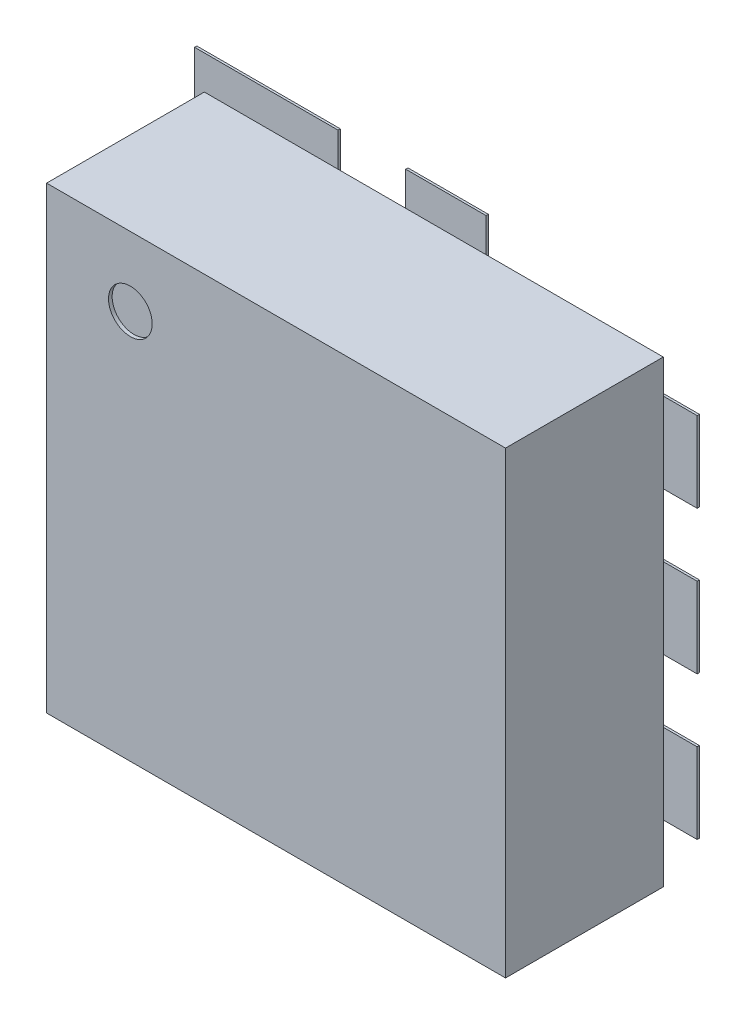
ISO-10303-21;
HEADER;
FILE_DESCRIPTION(('STEP AP214'),'2;1');
FILE_NAME('part.step','',(''),(''),'','','');
FILE_SCHEMA(('AUTOMOTIVE_DESIGN { 1 0 10303 214 1 1 1 1 }'));
ENDSEC;
DATA;
#1=APPLICATION_CONTEXT('core data for automotive mechanical design processes');
#2=APPLICATION_PROTOCOL_DEFINITION('international standard','automotive_design',2000,#1);
#3=PRODUCT_CONTEXT('',#1,'mechanical');
#4=PRODUCT('Part','Part','',(#3));
#5=PRODUCT_RELATED_PRODUCT_CATEGORY('part','',(#4));
#6=PRODUCT_DEFINITION_FORMATION('','',#4);
#7=PRODUCT_DEFINITION_CONTEXT('part definition',#1,'design');
#8=PRODUCT_DEFINITION('design','',#6,#7);
#9=PRODUCT_DEFINITION_SHAPE('','',#8);
#10=(LENGTH_UNIT() NAMED_UNIT(*) SI_UNIT(.MILLI.,.METRE.));
#11=(NAMED_UNIT(*) PLANE_ANGLE_UNIT() SI_UNIT($,.RADIAN.));
#12=(NAMED_UNIT(*) SI_UNIT($,.STERADIAN.) SOLID_ANGLE_UNIT());
#13=UNCERTAINTY_MEASURE_WITH_UNIT(LENGTH_MEASURE(1.E-05),#10,'distance_accuracy_value','');
#14=(GEOMETRIC_REPRESENTATION_CONTEXT(3) GLOBAL_UNCERTAINTY_ASSIGNED_CONTEXT((#13)) GLOBAL_UNIT_ASSIGNED_CONTEXT((#10,
#11,#12)) REPRESENTATION_CONTEXT('',''));
#15=CARTESIAN_POINT('',(0.,0.,0.));
#16=DIRECTION('',(0.,0.,1.));
#17=DIRECTION('',(1.,0.,0.));
#18=AXIS2_PLACEMENT_3D('',#15,#16,#17);
#19=CARTESIAN_POINT('',(0.,0.,0.0762));
#20=DIRECTION('',(0.,0.,1.));
#21=DIRECTION('',(1.,0.,0.));
#22=AXIS2_PLACEMENT_3D('',#19,#20,#21);
#23=PLANE('',#22);
#24=DIRECTION('',(0.,1.,0.));
#25=VECTOR('',#24,1.);
#26=CARTESIAN_POINT('',(0.1400048,-0.8759952,0.0762));
#27=LINE('',#26,#25);
#28=CARTESIAN_POINT('',(0.1400048,-0.8759952,0.0762));
#29=VERTEX_POINT('',#28);
#30=CARTESIAN_POINT('',(0.1400048,-0.3759962,0.0762));
#31=VERTEX_POINT('',#30);
#32=EDGE_CURVE('E485',#29,#31,#27,.T.);
#33=ORIENTED_EDGE('',*,*,#32,.F.);
#34=DIRECTION('',(1.,0.,0.));
#35=VECTOR('',#34,1.);
#36=CARTESIAN_POINT('',(-0.1400048,-0.8759952,0.0762));
#37=LINE('',#36,#35);
#38=CARTESIAN_POINT('',(-0.1400048,-0.8759952,0.0762));
#39=VERTEX_POINT('',#38);
#40=EDGE_CURVE('E490',#39,#29,#37,.T.);
#41=ORIENTED_EDGE('',*,*,#40,.F.);
#42=DIRECTION('',(0.,1.,0.));
#43=VECTOR('',#42,1.);
#44=CARTESIAN_POINT('',(-0.1400048,-0.3759962,0.0762));
#45=LINE('',#44,#43);
#46=CARTESIAN_POINT('',(-0.1400048,-0.3759962,0.0762));
#47=VERTEX_POINT('',#46);
#48=EDGE_CURVE('E639',#47,#39,#45,.F.);
#49=ORIENTED_EDGE('',*,*,#48,.F.);
#50=DIRECTION('',(1.,0.,0.));
#51=VECTOR('',#50,1.);
#52=CARTESIAN_POINT('',(0.1400048,-0.3759962,0.0762));
#53=LINE('',#52,#51);
#54=EDGE_CURVE('E501',#31,#47,#53,.F.);
#55=ORIENTED_EDGE('',*,*,#54,.F.);
#56=EDGE_LOOP('',(#33,#41,#49,#55));
#57=FACE_BOUND('',#56,.T.);
#58=ADVANCED_FACE('F16',(#57),#23,.F.);
#59=CARTESIAN_POINT('',(0.,0.,0.0762));
#60=DIRECTION('',(0.,0.,1.));
#61=DIRECTION('',(1.,0.,0.));
#62=AXIS2_PLACEMENT_3D('',#59,#60,#61);
#63=PLANE('',#62);
#64=DIRECTION('',(0.,1.,0.));
#65=VECTOR('',#64,1.);
#66=CARTESIAN_POINT('',(-0.3759962,-0.1400048,0.0762));
#67=LINE('',#66,#65);
#68=CARTESIAN_POINT('',(-0.3759962,-0.1400048,0.0762));
#69=VERTEX_POINT('',#68);
#70=CARTESIAN_POINT('',(-0.3759962,0.1400048,0.0762));
#71=VERTEX_POINT('',#70);
#72=EDGE_CURVE('E626',#69,#71,#67,.T.);
#73=ORIENTED_EDGE('',*,*,#72,.F.);
#74=DIRECTION('',(1.,0.,0.));
#75=VECTOR('',#74,1.);
#76=CARTESIAN_POINT('',(-0.8759952,-0.1400048,0.0762));
#77=LINE('',#76,#75);
#78=CARTESIAN_POINT('',(-0.8759952,-0.1400048,0.0762));
#79=VERTEX_POINT('',#78);
#80=EDGE_CURVE('E631',#79,#69,#77,.T.);
#81=ORIENTED_EDGE('',*,*,#80,.F.);
#82=DIRECTION('',(0.,1.,0.));
#83=VECTOR('',#82,1.);
#84=CARTESIAN_POINT('',(-0.8759952,0.1400048,0.0762));
#85=LINE('',#84,#83);
#86=CARTESIAN_POINT('',(-0.8759952,0.1400048,0.0762));
#87=VERTEX_POINT('',#86);
#88=EDGE_CURVE('E612',#87,#79,#85,.F.);
#89=ORIENTED_EDGE('',*,*,#88,.F.);
#90=DIRECTION('',(1.,0.,0.));
#91=VECTOR('',#90,1.);
#92=CARTESIAN_POINT('',(-0.3759962,0.1400048,0.0762));
#93=LINE('',#92,#91);
#94=EDGE_CURVE('E621',#71,#87,#93,.F.);
#95=ORIENTED_EDGE('',*,*,#94,.F.);
#96=EDGE_LOOP('',(#73,#81,#89,#95));
#97=FACE_BOUND('',#96,.T.);
#98=ADVANCED_FACE('F1440',(#97),#63,.F.);
#99=CARTESIAN_POINT('',(0.,0.,0.0762));
#100=DIRECTION('',(0.,0.,1.));
#101=DIRECTION('',(1.,0.,0.));
#102=AXIS2_PLACEMENT_3D('',#99,#100,#101);
#103=PLANE('',#102);
#104=DIRECTION('',(0.,1.,0.));
#105=VECTOR('',#104,1.);
#106=CARTESIAN_POINT('',(0.3759962,0.1400048,0.0762));
#107=LINE('',#106,#105);
#108=CARTESIAN_POINT('',(0.3759962,0.1400048,0.0762));
#109=VERTEX_POINT('',#108);
#110=CARTESIAN_POINT('',(0.3759962,-0.1400048,0.0762));
#111=VERTEX_POINT('',#110);
#112=EDGE_CURVE('E605',#109,#111,#107,.F.);
#113=ORIENTED_EDGE('',*,*,#112,.F.);
#114=DIRECTION('',(1.,0.,0.));
#115=VECTOR('',#114,1.);
#116=CARTESIAN_POINT('',(0.8759952,0.1400048,0.0762));
#117=LINE('',#116,#115);
#118=CARTESIAN_POINT('',(0.8759952,0.1400048,0.0762));
#119=VERTEX_POINT('',#118);
#120=EDGE_CURVE('E610',#119,#109,#117,.F.);
#121=ORIENTED_EDGE('',*,*,#120,.F.);
#122=DIRECTION('',(0.,1.,0.));
#123=VECTOR('',#122,1.);
#124=CARTESIAN_POINT('',(0.8759952,-0.1400048,0.0762));
#125=LINE('',#124,#123);
#126=CARTESIAN_POINT('',(0.8759952,-0.1400048,0.0762));
#127=VERTEX_POINT('',#126);
#128=EDGE_CURVE('E591',#127,#119,#125,.T.);
#129=ORIENTED_EDGE('',*,*,#128,.F.);
#130=DIRECTION('',(1.,0.,0.));
#131=VECTOR('',#130,1.);
#132=CARTESIAN_POINT('',(0.3759962,-0.1400048,0.0762));
#133=LINE('',#132,#131);
#134=EDGE_CURVE('E600',#111,#127,#133,.T.);
#135=ORIENTED_EDGE('',*,*,#134,.F.);
#136=EDGE_LOOP('',(#113,#121,#129,#135));
#137=FACE_BOUND('',#136,.T.);
#138=ADVANCED_FACE('F1437',(#137),#103,.F.);
#139=CARTESIAN_POINT('',(0.,0.,0.0762));
#140=DIRECTION('',(0.,0.,1.));
#141=DIRECTION('',(1.,0.,0.));
#142=AXIS2_PLACEMENT_3D('',#139,#140,#141);
#143=PLANE('',#142);
#144=DIRECTION('',(0.,1.,0.));
#145=VECTOR('',#144,1.);
#146=CARTESIAN_POINT('',(-0.8759952,0.8759952,0.0762));
#147=LINE('',#146,#145);
#148=CARTESIAN_POINT('',(-0.8759952,0.8759952,0.0762));
#149=VERTEX_POINT('',#148);
#150=CARTESIAN_POINT('',(-0.8759952,0.3759962,0.0762));
#151=VERTEX_POINT('',#150);
#152=EDGE_CURVE('E584',#149,#151,#147,.F.);
#153=ORIENTED_EDGE('',*,*,#152,.F.);
#154=DIRECTION('',(1.,0.,0.));
#155=VECTOR('',#154,1.);
#156=CARTESIAN_POINT('',(-0.3759962,0.8759952,0.0762));
#157=LINE('',#156,#155);
#158=CARTESIAN_POINT('',(-0.3759962,0.8759952,0.0762));
#159=VERTEX_POINT('',#158);
#160=EDGE_CURVE('E589',#159,#149,#157,.F.);
#161=ORIENTED_EDGE('',*,*,#160,.F.);
#162=DIRECTION('',(0.,1.,0.));
#163=VECTOR('',#162,1.);
#164=CARTESIAN_POINT('',(-0.3759962,0.3759962,0.0762));
#165=LINE('',#164,#163);
#166=CARTESIAN_POINT('',(-0.3759962,0.3759962,0.0762));
#167=VERTEX_POINT('',#166);
#168=EDGE_CURVE('E570',#167,#159,#165,.T.);
#169=ORIENTED_EDGE('',*,*,#168,.F.);
#170=DIRECTION('',(1.,0.,0.));
#171=VECTOR('',#170,1.);
#172=CARTESIAN_POINT('',(-0.8759952,0.3759962,0.0762));
#173=LINE('',#172,#171);
#174=EDGE_CURVE('E579',#151,#167,#173,.T.);
#175=ORIENTED_EDGE('',*,*,#174,.F.);
#176=EDGE_LOOP('',(#153,#161,#169,#175));
#177=FACE_BOUND('',#176,.T.);
#178=ADVANCED_FACE('F1433',(#177),#143,.F.);
#179=CARTESIAN_POINT('',(0.,0.,0.0762));
#180=DIRECTION('',(0.,0.,1.));
#181=DIRECTION('',(1.,0.,0.));
#182=AXIS2_PLACEMENT_3D('',#179,#180,#181);
#183=PLANE('',#182);
#184=DIRECTION('',(1.,0.,0.));
#185=VECTOR('',#184,1.);
#186=CARTESIAN_POINT('',(-0.1400048,0.3759962,0.0762));
#187=LINE('',#186,#185);
#188=CARTESIAN_POINT('',(-0.1400048,0.3759962,0.0762));
#189=VERTEX_POINT('',#188);
#190=CARTESIAN_POINT('',(0.1400048,0.3759962,0.0762));
#191=VERTEX_POINT('',#190);
#192=EDGE_CURVE('E563',#189,#191,#187,.T.);
#193=ORIENTED_EDGE('',*,*,#192,.F.);
#194=DIRECTION('',(0.,1.,0.));
#195=VECTOR('',#194,1.);
#196=CARTESIAN_POINT('',(-0.1400048,0.8759952,0.0762));
#197=LINE('',#196,#195);
#198=CARTESIAN_POINT('',(-0.1400048,0.8759952,0.0762));
#199=VERTEX_POINT('',#198);
#200=EDGE_CURVE('E568',#199,#189,#197,.F.);
#201=ORIENTED_EDGE('',*,*,#200,.F.);
#202=DIRECTION('',(1.,0.,0.));
#203=VECTOR('',#202,1.);
#204=CARTESIAN_POINT('',(0.1400048,0.8759952,0.0762));
#205=LINE('',#204,#203);
#206=CARTESIAN_POINT('',(0.1400048,0.8759952,0.0762));
#207=VERTEX_POINT('',#206);
#208=EDGE_CURVE('E549',#207,#199,#205,.F.);
#209=ORIENTED_EDGE('',*,*,#208,.F.);
#210=DIRECTION('',(0.,1.,0.));
#211=VECTOR('',#210,1.);
#212=CARTESIAN_POINT('',(0.1400048,0.3759962,0.0762));
#213=LINE('',#212,#211);
#214=EDGE_CURVE('E558',#191,#207,#213,.T.);
#215=ORIENTED_EDGE('',*,*,#214,.F.);
#216=EDGE_LOOP('',(#193,#201,#209,#215));
#217=FACE_BOUND('',#216,.T.);
#218=ADVANCED_FACE('F1430',(#217),#183,.F.);
#219=CARTESIAN_POINT('',(-0.3759962,-0.6400038,0.0762));
#220=DIRECTION('',(1.,0.,0.));
#221=DIRECTION('',(0.,0.,-1.));
#222=AXIS2_PLACEMENT_3D('',#219,#220,#221);
#223=PLANE('',#222);
#224=DIRECTION('',(0.,0.,-1.));
#225=VECTOR('',#224,1.);
#226=CARTESIAN_POINT('',(-0.3759962,-0.6400038,0.0762));
#227=LINE('',#226,#225);
#228=CARTESIAN_POINT('',(-0.3759962,-0.6400038,0.0762));
#229=VERTEX_POINT('',#228);
#230=CARTESIAN_POINT('',(-0.3759962,-0.6400038,0.084074));
#231=VERTEX_POINT('',#230);
#232=EDGE_CURVE('E673',#229,#231,#227,.F.);
#233=ORIENTED_EDGE('',*,*,#232,.F.);
#234=DIRECTION('',(0.,1.,0.));
#235=VECTOR('',#234,1.);
#236=CARTESIAN_POINT('',(-0.3759962,0.,0.0762));
#237=LINE('',#236,#235);
#238=CARTESIAN_POINT('',(-0.3759962,-0.3599942,0.0762));
#239=VERTEX_POINT('',#238);
#240=EDGE_CURVE('E530',#229,#239,#237,.T.);
#241=ORIENTED_EDGE('',*,*,#240,.T.);
#242=DIRECTION('',(0.,0.,1.));
#243=VECTOR('',#242,1.);
#244=CARTESIAN_POINT('',(-0.3759962,-0.3599942,0.0762));
#245=LINE('',#244,#243);
#246=CARTESIAN_POINT('',(-0.3759962,-0.3599942,0.084074));
#247=VERTEX_POINT('',#246);
#248=EDGE_CURVE('E514',#247,#239,#245,.F.);
#249=ORIENTED_EDGE('',*,*,#248,.F.);
#250=DIRECTION('',(0.,1.,0.));
#251=VECTOR('',#250,1.);
#252=CARTESIAN_POINT('',(-0.3759962,0.,0.084074));
#253=LINE('',#252,#251);
#254=EDGE_CURVE('E668',#231,#247,#253,.T.);
#255=ORIENTED_EDGE('',*,*,#254,.F.);
#256=EDGE_LOOP('',(#233,#241,#249,#255));
#257=FACE_BOUND('',#256,.T.);
#258=ADVANCED_FACE('F1424',(#257),#223,.T.);
#259=CARTESIAN_POINT('',(-0.3759962,-0.3599942,0.0762));
#260=DIRECTION('',(0.,1.,0.));
#261=DIRECTION('',(0.,0.,1.));
#262=AXIS2_PLACEMENT_3D('',#259,#260,#261);
#263=PLANE('',#262);
#264=ORIENTED_EDGE('',*,*,#248,.T.);
#265=DIRECTION('',(1.,0.,0.));
#266=VECTOR('',#265,1.);
#267=CARTESIAN_POINT('',(0.,-0.3599942,0.0762));
#268=LINE('',#267,#266);
#269=CARTESIAN_POINT('',(-0.8759952,-0.3599942,0.0762));
#270=VERTEX_POINT('',#269);
#271=EDGE_CURVE('E520',#239,#270,#268,.F.);
#272=ORIENTED_EDGE('',*,*,#271,.T.);
#273=DIRECTION('',(0.,0.,1.));
#274=VECTOR('',#273,1.);
#275=CARTESIAN_POINT('',(-0.8759952,-0.3599942,0.0762));
#276=LINE('',#275,#274);
#277=CARTESIAN_POINT('',(-0.8759952,-0.3599942,0.084074));
#278=VERTEX_POINT('',#277);
#279=EDGE_CURVE('E499',#278,#270,#276,.F.);
#280=ORIENTED_EDGE('',*,*,#279,.F.);
#281=DIRECTION('',(1.,0.,0.));
#282=VECTOR('',#281,1.);
#283=CARTESIAN_POINT('',(0.,-0.3599942,0.084074));
#284=LINE('',#283,#282);
#285=EDGE_CURVE('E522',#247,#278,#284,.F.);
#286=ORIENTED_EDGE('',*,*,#285,.F.);
#287=EDGE_LOOP('',(#264,#272,#280,#286));
#288=FACE_BOUND('',#287,.T.);
#289=ADVANCED_FACE('F519',(#288),#263,.T.);
#290=CARTESIAN_POINT('',(-0.8759952,-0.3599942,0.0762));
#291=DIRECTION('',(-1.,0.,0.));
#292=DIRECTION('',(0.,0.,1.));
#293=AXIS2_PLACEMENT_3D('',#290,#291,#292);
#294=PLANE('',#293);
#295=ORIENTED_EDGE('',*,*,#279,.T.);
#296=DIRECTION('',(0.,1.,0.));
#297=VECTOR('',#296,1.);
#298=CARTESIAN_POINT('',(-0.8759952,0.,0.0762));
#299=LINE('',#298,#297);
#300=CARTESIAN_POINT('',(-0.8759952,-0.6400038,0.0762));
#301=VERTEX_POINT('',#300);
#302=EDGE_CURVE('E533',#270,#301,#299,.F.);
#303=ORIENTED_EDGE('',*,*,#302,.T.);
#304=DIRECTION('',(0.,0.,-1.));
#305=VECTOR('',#304,1.);
#306=CARTESIAN_POINT('',(-0.8759952,-0.6400038,0.0762));
#307=LINE('',#306,#305);
#308=CARTESIAN_POINT('',(-0.8759952,-0.6400038,0.084074));
#309=VERTEX_POINT('',#308);
#310=EDGE_CURVE('E537',#309,#301,#307,.T.);
#311=ORIENTED_EDGE('',*,*,#310,.F.);
#312=DIRECTION('',(0.,1.,0.));
#313=VECTOR('',#312,1.);
#314=CARTESIAN_POINT('',(-0.8759952,0.,0.084074));
#315=LINE('',#314,#313);
#316=EDGE_CURVE('E664',#278,#309,#315,.F.);
#317=ORIENTED_EDGE('',*,*,#316,.F.);
#318=EDGE_LOOP('',(#295,#303,#311,#317));
#319=FACE_BOUND('',#318,.T.);
#320=ADVANCED_FACE('F1416',(#319),#294,.T.);
#321=CARTESIAN_POINT('',(-0.1400048,-0.8759952,0.0762));
#322=DIRECTION('',(0.,-1.,0.));
#323=DIRECTION('',(0.,0.,-1.));
#324=AXIS2_PLACEMENT_3D('',#321,#322,#323);
#325=PLANE('',#324);
#326=DIRECTION('',(0.,0.,1.));
#327=VECTOR('',#326,1.);
#328=CARTESIAN_POINT('',(-0.1400048,-0.8759952,0.0762));
#329=LINE('',#328,#327);
#330=CARTESIAN_POINT('',(-0.1400048,-0.8759952,0.084074));
#331=VERTEX_POINT('',#330);
#332=EDGE_CURVE('E495',#39,#331,#329,.T.);
#333=ORIENTED_EDGE('',*,*,#332,.F.);
#334=ORIENTED_EDGE('',*,*,#40,.T.);
#335=DIRECTION('',(0.,0.,-1.));
#336=VECTOR('',#335,1.);
#337=CARTESIAN_POINT('',(0.1400048,-0.8759952,0.0762));
#338=LINE('',#337,#336);
#339=CARTESIAN_POINT('',(0.1400048,-0.8759952,0.084074));
#340=VERTEX_POINT('',#339);
#341=EDGE_CURVE('E492',#340,#29,#338,.T.);
#342=ORIENTED_EDGE('',*,*,#341,.F.);
#343=DIRECTION('',(1.,0.,0.));
#344=VECTOR('',#343,1.);
#345=CARTESIAN_POINT('',(0.,-0.8759952,0.084074));
#346=LINE('',#345,#344);
#347=EDGE_CURVE('E656',#331,#340,#346,.T.);
#348=ORIENTED_EDGE('',*,*,#347,.F.);
#349=EDGE_LOOP('',(#333,#334,#342,#348));
#350=FACE_BOUND('',#349,.T.);
#351=ADVANCED_FACE('F491',(#350),#325,.T.);
#352=CARTESIAN_POINT('',(0.1400048,-0.8759952,0.0762));
#353=DIRECTION('',(1.,0.,0.));
#354=DIRECTION('',(0.,0.,-1.));
#355=AXIS2_PLACEMENT_3D('',#352,#353,#354);
#356=PLANE('',#355);
#357=ORIENTED_EDGE('',*,*,#341,.T.);
#358=ORIENTED_EDGE('',*,*,#32,.T.);
#359=DIRECTION('',(0.,0.,1.));
#360=VECTOR('',#359,1.);
#361=CARTESIAN_POINT('',(0.1400048,-0.3759962,0.0762));
#362=LINE('',#361,#360);
#363=CARTESIAN_POINT('',(0.1400048,-0.3759962,0.084074));
#364=VERTEX_POINT('',#363);
#365=EDGE_CURVE('E503',#364,#31,#362,.F.);
#366=ORIENTED_EDGE('',*,*,#365,.F.);
#367=DIRECTION('',(0.,1.,0.));
#368=VECTOR('',#367,1.);
#369=CARTESIAN_POINT('',(0.1400048,0.,0.084074));
#370=LINE('',#369,#368);
#371=EDGE_CURVE('E507',#340,#364,#370,.T.);
#372=ORIENTED_EDGE('',*,*,#371,.F.);
#373=EDGE_LOOP('',(#357,#358,#366,#372));
#374=FACE_BOUND('',#373,.T.);
#375=ADVANCED_FACE('F505',(#374),#356,.T.);
#376=CARTESIAN_POINT('',(0.1400048,-0.3759962,0.0762));
#377=DIRECTION('',(0.,1.,0.));
#378=DIRECTION('',(0.,0.,1.));
#379=AXIS2_PLACEMENT_3D('',#376,#377,#378);
#380=PLANE('',#379);
#381=ORIENTED_EDGE('',*,*,#365,.T.);
#382=ORIENTED_EDGE('',*,*,#54,.T.);
#383=DIRECTION('',(0.,0.,1.));
#384=VECTOR('',#383,1.);
#385=CARTESIAN_POINT('',(-0.1400048,-0.3759962,0.0762));
#386=LINE('',#385,#384);
#387=CARTESIAN_POINT('',(-0.1400048,-0.3759962,0.084074));
#388=VERTEX_POINT('',#387);
#389=EDGE_CURVE('E641',#388,#47,#386,.F.);
#390=ORIENTED_EDGE('',*,*,#389,.F.);
#391=DIRECTION('',(1.,0.,0.));
#392=VECTOR('',#391,1.);
#393=CARTESIAN_POINT('',(0.,-0.3759962,0.084074));
#394=LINE('',#393,#392);
#395=EDGE_CURVE('E649',#364,#388,#394,.F.);
#396=ORIENTED_EDGE('',*,*,#395,.F.);
#397=EDGE_LOOP('',(#381,#382,#390,#396));
#398=FACE_BOUND('',#397,.T.);
#399=ADVANCED_FACE('F647',(#398),#380,.T.);
#400=CARTESIAN_POINT('',(-0.1400048,-0.3759962,0.0762));
#401=DIRECTION('',(-1.,0.,0.));
#402=DIRECTION('',(0.,0.,1.));
#403=AXIS2_PLACEMENT_3D('',#400,#401,#402);
#404=PLANE('',#403);
#405=ORIENTED_EDGE('',*,*,#389,.T.);
#406=ORIENTED_EDGE('',*,*,#48,.T.);
#407=ORIENTED_EDGE('',*,*,#332,.T.);
#408=DIRECTION('',(0.,1.,0.));
#409=VECTOR('',#408,1.);
#410=CARTESIAN_POINT('',(-0.1400048,0.,0.084074));
#411=LINE('',#410,#409);
#412=EDGE_CURVE('E653',#388,#331,#411,.F.);
#413=ORIENTED_EDGE('',*,*,#412,.F.);
#414=EDGE_LOOP('',(#405,#406,#407,#413));
#415=FACE_BOUND('',#414,.T.);
#416=ADVANCED_FACE('F809',(#415),#404,.T.);
#417=CARTESIAN_POINT('',(0.8759952,-0.6400038,0.0762));
#418=DIRECTION('',(1.,0.,0.));
#419=DIRECTION('',(0.,0.,-1.));
#420=AXIS2_PLACEMENT_3D('',#417,#418,#419);
#421=PLANE('',#420);
#422=DIRECTION('',(0.,0.,-1.));
#423=VECTOR('',#422,1.);
#424=CARTESIAN_POINT('',(0.8759952,-0.6400038,0.0762));
#425=LINE('',#424,#423);
#426=CARTESIAN_POINT('',(0.8759952,-0.6400038,0.0762));
#427=VERTEX_POINT('',#426);
#428=CARTESIAN_POINT('',(0.8759952,-0.6400038,0.084074));
#429=VERTEX_POINT('',#428);
#430=EDGE_CURVE('E807',#427,#429,#425,.F.);
#431=ORIENTED_EDGE('',*,*,#430,.F.);
#432=DIRECTION('',(0.,1.,0.));
#433=VECTOR('',#432,1.);
#434=CARTESIAN_POINT('',(0.8759952,0.,0.0762));
#435=LINE('',#434,#433);
#436=CARTESIAN_POINT('',(0.8759952,-0.3599942,0.0762));
#437=VERTEX_POINT('',#436);
#438=EDGE_CURVE('E799',#427,#437,#435,.T.);
#439=ORIENTED_EDGE('',*,*,#438,.T.);
#440=DIRECTION('',(0.,0.,1.));
#441=VECTOR('',#440,1.);
#442=CARTESIAN_POINT('',(0.8759952,-0.3599942,0.0762));
#443=LINE('',#442,#441);
#444=CARTESIAN_POINT('',(0.8759952,-0.3599942,0.084074));
#445=VERTEX_POINT('',#444);
#446=EDGE_CURVE('E636',#445,#437,#443,.F.);
#447=ORIENTED_EDGE('',*,*,#446,.F.);
#448=DIRECTION('',(0.,1.,0.));
#449=VECTOR('',#448,1.);
#450=CARTESIAN_POINT('',(0.8759952,0.,0.084074));
#451=LINE('',#450,#449);
#452=EDGE_CURVE('E787',#429,#445,#451,.T.);
#453=ORIENTED_EDGE('',*,*,#452,.F.);
#454=EDGE_LOOP('',(#431,#439,#447,#453));
#455=FACE_BOUND('',#454,.T.);
#456=ADVANCED_FACE('F811',(#455),#421,.T.);
#457=CARTESIAN_POINT('',(0.8759952,-0.3599942,0.0762));
#458=DIRECTION('',(0.,1.,0.));
#459=DIRECTION('',(0.,0.,1.));
#460=AXIS2_PLACEMENT_3D('',#457,#458,#459);
#461=PLANE('',#460);
#462=ORIENTED_EDGE('',*,*,#446,.T.);
#463=DIRECTION('',(1.,0.,0.));
#464=VECTOR('',#463,1.);
#465=CARTESIAN_POINT('',(0.,-0.3599942,0.0762));
#466=LINE('',#465,#464);
#467=CARTESIAN_POINT('',(0.3759962,-0.3599942,0.0762));
#468=VERTEX_POINT('',#467);
#469=EDGE_CURVE('E797',#437,#468,#466,.F.);
#470=ORIENTED_EDGE('',*,*,#469,.T.);
#471=DIRECTION('',(0.,0.,1.));
#472=VECTOR('',#471,1.);
#473=CARTESIAN_POINT('',(0.3759962,-0.3599942,0.0762));
#474=LINE('',#473,#472);
#475=CARTESIAN_POINT('',(0.3759962,-0.3599942,0.084074));
#476=VERTEX_POINT('',#475);
#477=EDGE_CURVE('E633',#476,#468,#474,.F.);
#478=ORIENTED_EDGE('',*,*,#477,.F.);
#479=DIRECTION('',(1.,0.,0.));
#480=VECTOR('',#479,1.);
#481=CARTESIAN_POINT('',(0.,-0.3599942,0.084074));
#482=LINE('',#481,#480);
#483=EDGE_CURVE('E784',#445,#476,#482,.F.);
#484=ORIENTED_EDGE('',*,*,#483,.F.);
#485=EDGE_LOOP('',(#462,#470,#478,#484));
#486=FACE_BOUND('',#485,.T.);
#487=ADVANCED_FACE('F818',(#486),#461,.T.);
#488=CARTESIAN_POINT('',(0.3759962,-0.3599942,0.0762));
#489=DIRECTION('',(-1.,0.,0.));
#490=DIRECTION('',(0.,0.,1.));
#491=AXIS2_PLACEMENT_3D('',#488,#489,#490);
#492=PLANE('',#491);
#493=ORIENTED_EDGE('',*,*,#477,.T.);
#494=DIRECTION('',(0.,1.,0.));
#495=VECTOR('',#494,1.);
#496=CARTESIAN_POINT('',(0.3759962,0.,0.0762));
#497=LINE('',#496,#495);
#498=CARTESIAN_POINT('',(0.3759962,-0.6400038,0.0762));
#499=VERTEX_POINT('',#498);
#500=EDGE_CURVE('E795',#468,#499,#497,.F.);
#501=ORIENTED_EDGE('',*,*,#500,.T.);
#502=DIRECTION('',(0.,0.,-1.));
#503=VECTOR('',#502,1.);
#504=CARTESIAN_POINT('',(0.3759962,-0.6400038,0.0762));
#505=LINE('',#504,#503);
#506=CARTESIAN_POINT('',(0.3759962,-0.6400038,0.084074));
#507=VERTEX_POINT('',#506);
#508=EDGE_CURVE('E804',#507,#499,#505,.T.);
#509=ORIENTED_EDGE('',*,*,#508,.F.);
#510=DIRECTION('',(0.,1.,0.));
#511=VECTOR('',#510,1.);
#512=CARTESIAN_POINT('',(0.3759962,0.,0.084074));
#513=LINE('',#512,#511);
#514=EDGE_CURVE('E781',#476,#507,#513,.F.);
#515=ORIENTED_EDGE('',*,*,#514,.F.);
#516=EDGE_LOOP('',(#493,#501,#509,#515));
#517=FACE_BOUND('',#516,.T.);
#518=ADVANCED_FACE('F1129',(#517),#492,.T.);
#519=CARTESIAN_POINT('',(-0.8759952,-0.1400048,0.0762));
#520=DIRECTION('',(0.,-1.,0.));
#521=DIRECTION('',(0.,0.,-1.));
#522=AXIS2_PLACEMENT_3D('',#519,#520,#521);
#523=PLANE('',#522);
#524=DIRECTION('',(0.,0.,1.));
#525=VECTOR('',#524,1.);
#526=CARTESIAN_POINT('',(-0.8759952,-0.1400048,0.0762));
#527=LINE('',#526,#525);
#528=CARTESIAN_POINT('',(-0.8759952,-0.1400048,0.084074));
#529=VERTEX_POINT('',#528);
#530=EDGE_CURVE('E618',#79,#529,#527,.T.);
#531=ORIENTED_EDGE('',*,*,#530,.F.);
#532=ORIENTED_EDGE('',*,*,#80,.T.);
#533=DIRECTION('',(0.,0.,-1.));
#534=VECTOR('',#533,1.);
#535=CARTESIAN_POINT('',(-0.3759962,-0.1400048,0.0762));
#536=LINE('',#535,#534);
#537=CARTESIAN_POINT('',(-0.3759962,-0.1400048,0.084074));
#538=VERTEX_POINT('',#537);
#539=EDGE_CURVE('E628',#538,#69,#536,.T.);
#540=ORIENTED_EDGE('',*,*,#539,.F.);
#541=DIRECTION('',(1.,0.,0.));
#542=VECTOR('',#541,1.);
#543=CARTESIAN_POINT('',(0.,-0.1400048,0.084074));
#544=LINE('',#543,#542);
#545=EDGE_CURVE('E775',#529,#538,#544,.T.);
#546=ORIENTED_EDGE('',*,*,#545,.F.);
#547=EDGE_LOOP('',(#531,#532,#540,#546));
#548=FACE_BOUND('',#547,.T.);
#549=ADVANCED_FACE('F1125',(#548),#523,.T.);
#550=CARTESIAN_POINT('',(-0.3759962,-0.1400048,0.0762));
#551=DIRECTION('',(1.,0.,0.));
#552=DIRECTION('',(0.,0.,-1.));
#553=AXIS2_PLACEMENT_3D('',#550,#551,#552);
#554=PLANE('',#553);
#555=ORIENTED_EDGE('',*,*,#539,.T.);
#556=ORIENTED_EDGE('',*,*,#72,.T.);
#557=DIRECTION('',(0.,0.,1.));
#558=VECTOR('',#557,1.);
#559=CARTESIAN_POINT('',(-0.3759962,0.1400048,0.0762));
#560=LINE('',#559,#558);
#561=CARTESIAN_POINT('',(-0.3759962,0.1400048,0.084074));
#562=VERTEX_POINT('',#561);
#563=EDGE_CURVE('E623',#562,#71,#560,.F.);
#564=ORIENTED_EDGE('',*,*,#563,.F.);
#565=DIRECTION('',(0.,1.,0.));
#566=VECTOR('',#565,1.);
#567=CARTESIAN_POINT('',(-0.3759962,0.,0.084074));
#568=LINE('',#567,#566);
#569=EDGE_CURVE('E772',#538,#562,#568,.T.);
#570=ORIENTED_EDGE('',*,*,#569,.F.);
#571=EDGE_LOOP('',(#555,#556,#564,#570));
#572=FACE_BOUND('',#571,.T.);
#573=ADVANCED_FACE('F1121',(#572),#554,.T.);
#574=CARTESIAN_POINT('',(-0.3759962,0.1400048,0.0762));
#575=DIRECTION('',(0.,1.,0.));
#576=DIRECTION('',(0.,0.,1.));
#577=AXIS2_PLACEMENT_3D('',#574,#575,#576);
#578=PLANE('',#577);
#579=ORIENTED_EDGE('',*,*,#563,.T.);
#580=ORIENTED_EDGE('',*,*,#94,.T.);
#581=DIRECTION('',(0.,0.,1.));
#582=VECTOR('',#581,1.);
#583=CARTESIAN_POINT('',(-0.8759952,0.1400048,0.0762));
#584=LINE('',#583,#582);
#585=CARTESIAN_POINT('',(-0.8759952,0.1400048,0.084074));
#586=VERTEX_POINT('',#585);
#587=EDGE_CURVE('E615',#586,#87,#584,.F.);
#588=ORIENTED_EDGE('',*,*,#587,.F.);
#589=DIRECTION('',(1.,0.,0.));
#590=VECTOR('',#589,1.);
#591=CARTESIAN_POINT('',(0.,0.1400048,0.084074));
#592=LINE('',#591,#590);
#593=EDGE_CURVE('E769',#562,#586,#592,.F.);
#594=ORIENTED_EDGE('',*,*,#593,.F.);
#595=EDGE_LOOP('',(#579,#580,#588,#594));
#596=FACE_BOUND('',#595,.T.);
#597=ADVANCED_FACE('F1117',(#596),#578,.T.);
#598=CARTESIAN_POINT('',(-0.8759952,0.1400048,0.0762));
#599=DIRECTION('',(-1.,0.,0.));
#600=DIRECTION('',(0.,0.,1.));
#601=AXIS2_PLACEMENT_3D('',#598,#599,#600);
#602=PLANE('',#601);
#603=ORIENTED_EDGE('',*,*,#587,.T.);
#604=ORIENTED_EDGE('',*,*,#88,.T.);
#605=ORIENTED_EDGE('',*,*,#530,.T.);
#606=DIRECTION('',(0.,1.,0.));
#607=VECTOR('',#606,1.);
#608=CARTESIAN_POINT('',(-0.8759952,0.,0.084074));
#609=LINE('',#608,#607);
#610=EDGE_CURVE('E766',#586,#529,#609,.F.);
#611=ORIENTED_EDGE('',*,*,#610,.F.);
#612=EDGE_LOOP('',(#603,#604,#605,#611));
#613=FACE_BOUND('',#612,.T.);
#614=ADVANCED_FACE('F1113',(#613),#602,.T.);
#615=CARTESIAN_POINT('',(0.8759952,0.1400048,0.0762));
#616=DIRECTION('',(0.,1.,0.));
#617=DIRECTION('',(0.,0.,1.));
#618=AXIS2_PLACEMENT_3D('',#615,#616,#617);
#619=PLANE('',#618);
#620=DIRECTION('',(0.,0.,-1.));
#621=VECTOR('',#620,1.);
#622=CARTESIAN_POINT('',(0.8759952,0.1400048,0.0762));
#623=LINE('',#622,#621);
#624=CARTESIAN_POINT('',(0.8759952,0.1400048,0.084074));
#625=VERTEX_POINT('',#624);
#626=EDGE_CURVE('E597',#119,#625,#623,.F.);
#627=ORIENTED_EDGE('',*,*,#626,.F.);
#628=ORIENTED_EDGE('',*,*,#120,.T.);
#629=DIRECTION('',(0.,0.,1.));
#630=VECTOR('',#629,1.);
#631=CARTESIAN_POINT('',(0.3759962,0.1400048,0.0762));
#632=LINE('',#631,#630);
#633=CARTESIAN_POINT('',(0.3759962,0.1400048,0.084074));
#634=VERTEX_POINT('',#633);
#635=EDGE_CURVE('E607',#634,#109,#632,.F.);
#636=ORIENTED_EDGE('',*,*,#635,.F.);
#637=DIRECTION('',(1.,0.,0.));
#638=VECTOR('',#637,1.);
#639=CARTESIAN_POINT('',(0.,0.1400048,0.084074));
#640=LINE('',#639,#638);
#641=EDGE_CURVE('E763',#625,#634,#640,.F.);
#642=ORIENTED_EDGE('',*,*,#641,.F.);
#643=EDGE_LOOP('',(#627,#628,#636,#642));
#644=FACE_BOUND('',#643,.T.);
#645=ADVANCED_FACE('F1109',(#644),#619,.T.);
#646=CARTESIAN_POINT('',(0.3759962,0.1400048,0.0762));
#647=DIRECTION('',(-1.,0.,0.));
#648=DIRECTION('',(0.,0.,1.));
#649=AXIS2_PLACEMENT_3D('',#646,#647,#648);
#650=PLANE('',#649);
#651=ORIENTED_EDGE('',*,*,#635,.T.);
#652=ORIENTED_EDGE('',*,*,#112,.T.);
#653=DIRECTION('',(0.,0.,-1.));
#654=VECTOR('',#653,1.);
#655=CARTESIAN_POINT('',(0.3759962,-0.1400048,0.0762));
#656=LINE('',#655,#654);
#657=CARTESIAN_POINT('',(0.3759962,-0.1400048,0.084074));
#658=VERTEX_POINT('',#657);
#659=EDGE_CURVE('E602',#658,#111,#656,.T.);
#660=ORIENTED_EDGE('',*,*,#659,.F.);
#661=DIRECTION('',(0.,1.,0.));
#662=VECTOR('',#661,1.);
#663=CARTESIAN_POINT('',(0.3759962,0.,0.084074));
#664=LINE('',#663,#662);
#665=EDGE_CURVE('E760',#634,#658,#664,.F.);
#666=ORIENTED_EDGE('',*,*,#665,.F.);
#667=EDGE_LOOP('',(#651,#652,#660,#666));
#668=FACE_BOUND('',#667,.T.);
#669=ADVANCED_FACE('F1105',(#668),#650,.T.);
#670=CARTESIAN_POINT('',(0.3759962,-0.1400048,0.0762));
#671=DIRECTION('',(0.,-1.,0.));
#672=DIRECTION('',(0.,0.,-1.));
#673=AXIS2_PLACEMENT_3D('',#670,#671,#672);
#674=PLANE('',#673);
#675=ORIENTED_EDGE('',*,*,#659,.T.);
#676=ORIENTED_EDGE('',*,*,#134,.T.);
#677=DIRECTION('',(0.,0.,-1.));
#678=VECTOR('',#677,1.);
#679=CARTESIAN_POINT('',(0.8759952,-0.1400048,0.0762));
#680=LINE('',#679,#678);
#681=CARTESIAN_POINT('',(0.8759952,-0.1400048,0.084074));
#682=VERTEX_POINT('',#681);
#683=EDGE_CURVE('E594',#682,#127,#680,.T.);
#684=ORIENTED_EDGE('',*,*,#683,.F.);
#685=DIRECTION('',(1.,0.,0.));
#686=VECTOR('',#685,1.);
#687=CARTESIAN_POINT('',(0.,-0.1400048,0.084074));
#688=LINE('',#687,#686);
#689=EDGE_CURVE('E757',#658,#682,#688,.T.);
#690=ORIENTED_EDGE('',*,*,#689,.F.);
#691=EDGE_LOOP('',(#675,#676,#684,#690));
#692=FACE_BOUND('',#691,.T.);
#693=ADVANCED_FACE('F1101',(#692),#674,.T.);
#694=CARTESIAN_POINT('',(0.8759952,-0.1400048,0.0762));
#695=DIRECTION('',(1.,0.,0.));
#696=DIRECTION('',(0.,0.,-1.));
#697=AXIS2_PLACEMENT_3D('',#694,#695,#696);
#698=PLANE('',#697);
#699=ORIENTED_EDGE('',*,*,#683,.T.);
#700=ORIENTED_EDGE('',*,*,#128,.T.);
#701=ORIENTED_EDGE('',*,*,#626,.T.);
#702=DIRECTION('',(0.,1.,0.));
#703=VECTOR('',#702,1.);
#704=CARTESIAN_POINT('',(0.8759952,0.,0.084074));
#705=LINE('',#704,#703);
#706=EDGE_CURVE('E754',#682,#625,#705,.T.);
#707=ORIENTED_EDGE('',*,*,#706,.F.);
#708=EDGE_LOOP('',(#699,#700,#701,#707));
#709=FACE_BOUND('',#708,.T.);
#710=ADVANCED_FACE('F1097',(#709),#698,.T.);
#711=CARTESIAN_POINT('',(-0.3759962,0.8759952,0.0762));
#712=DIRECTION('',(0.,1.,0.));
#713=DIRECTION('',(0.,0.,1.));
#714=AXIS2_PLACEMENT_3D('',#711,#712,#713);
#715=PLANE('',#714);
#716=DIRECTION('',(0.,0.,-1.));
#717=VECTOR('',#716,1.);
#718=CARTESIAN_POINT('',(-0.3759962,0.8759952,0.0762));
#719=LINE('',#718,#717);
#720=CARTESIAN_POINT('',(-0.3759962,0.8759952,0.084074));
#721=VERTEX_POINT('',#720);
#722=EDGE_CURVE('E576',#159,#721,#719,.F.);
#723=ORIENTED_EDGE('',*,*,#722,.F.);
#724=ORIENTED_EDGE('',*,*,#160,.T.);
#725=DIRECTION('',(0.,0.,1.));
#726=VECTOR('',#725,1.);
#727=CARTESIAN_POINT('',(-0.8759952,0.8759952,0.0762));
#728=LINE('',#727,#726);
#729=CARTESIAN_POINT('',(-0.8759952,0.8759952,0.084074));
#730=VERTEX_POINT('',#729);
#731=EDGE_CURVE('E586',#730,#149,#728,.F.);
#732=ORIENTED_EDGE('',*,*,#731,.F.);
#733=DIRECTION('',(1.,0.,0.));
#734=VECTOR('',#733,1.);
#735=CARTESIAN_POINT('',(0.,0.8759952,0.084074));
#736=LINE('',#735,#734);
#737=EDGE_CURVE('E751',#721,#730,#736,.F.);
#738=ORIENTED_EDGE('',*,*,#737,.F.);
#739=EDGE_LOOP('',(#723,#724,#732,#738));
#740=FACE_BOUND('',#739,.T.);
#741=ADVANCED_FACE('F1093',(#740),#715,.T.);
#742=CARTESIAN_POINT('',(-0.8759952,0.8759952,0.0762));
#743=DIRECTION('',(-1.,0.,0.));
#744=DIRECTION('',(0.,0.,1.));
#745=AXIS2_PLACEMENT_3D('',#742,#743,#744);
#746=PLANE('',#745);
#747=ORIENTED_EDGE('',*,*,#731,.T.);
#748=ORIENTED_EDGE('',*,*,#152,.T.);
#749=DIRECTION('',(0.,0.,-1.));
#750=VECTOR('',#749,1.);
#751=CARTESIAN_POINT('',(-0.8759952,0.3759962,0.0762));
#752=LINE('',#751,#750);
#753=CARTESIAN_POINT('',(-0.8759952,0.3759962,0.084074));
#754=VERTEX_POINT('',#753);
#755=EDGE_CURVE('E581',#754,#151,#752,.T.);
#756=ORIENTED_EDGE('',*,*,#755,.F.);
#757=DIRECTION('',(0.,1.,0.));
#758=VECTOR('',#757,1.);
#759=CARTESIAN_POINT('',(-0.8759952,0.,0.084074));
#760=LINE('',#759,#758);
#761=EDGE_CURVE('E748',#730,#754,#760,.F.);
#762=ORIENTED_EDGE('',*,*,#761,.F.);
#763=EDGE_LOOP('',(#747,#748,#756,#762));
#764=FACE_BOUND('',#763,.T.);
#765=ADVANCED_FACE('F1089',(#764),#746,.T.);
#766=CARTESIAN_POINT('',(-0.8759952,0.3759962,0.0762));
#767=DIRECTION('',(0.,-1.,0.));
#768=DIRECTION('',(0.,0.,-1.));
#769=AXIS2_PLACEMENT_3D('',#766,#767,#768);
#770=PLANE('',#769);
#771=ORIENTED_EDGE('',*,*,#755,.T.);
#772=ORIENTED_EDGE('',*,*,#174,.T.);
#773=DIRECTION('',(0.,0.,-1.));
#774=VECTOR('',#773,1.);
#775=CARTESIAN_POINT('',(-0.3759962,0.3759962,0.0762));
#776=LINE('',#775,#774);
#777=CARTESIAN_POINT('',(-0.3759962,0.3759962,0.084074));
#778=VERTEX_POINT('',#777);
#779=EDGE_CURVE('E573',#778,#167,#776,.T.);
#780=ORIENTED_EDGE('',*,*,#779,.F.);
#781=DIRECTION('',(1.,0.,0.));
#782=VECTOR('',#781,1.);
#783=CARTESIAN_POINT('',(0.,0.3759962,0.084074));
#784=LINE('',#783,#782);
#785=EDGE_CURVE('E745',#754,#778,#784,.T.);
#786=ORIENTED_EDGE('',*,*,#785,.F.);
#787=EDGE_LOOP('',(#771,#772,#780,#786));
#788=FACE_BOUND('',#787,.T.);
#789=ADVANCED_FACE('F1085',(#788),#770,.T.);
#790=CARTESIAN_POINT('',(-0.3759962,0.3759962,0.0762));
#791=DIRECTION('',(1.,0.,0.));
#792=DIRECTION('',(0.,0.,-1.));
#793=AXIS2_PLACEMENT_3D('',#790,#791,#792);
#794=PLANE('',#793);
#795=ORIENTED_EDGE('',*,*,#779,.T.);
#796=ORIENTED_EDGE('',*,*,#168,.T.);
#797=ORIENTED_EDGE('',*,*,#722,.T.);
#798=DIRECTION('',(0.,1.,0.));
#799=VECTOR('',#798,1.);
#800=CARTESIAN_POINT('',(-0.3759962,0.,0.084074));
#801=LINE('',#800,#799);
#802=EDGE_CURVE('E742',#778,#721,#801,.T.);
#803=ORIENTED_EDGE('',*,*,#802,.F.);
#804=EDGE_LOOP('',(#795,#796,#797,#803));
#805=FACE_BOUND('',#804,.T.);
#806=ADVANCED_FACE('F1081',(#805),#794,.T.);
#807=CARTESIAN_POINT('',(-0.1400048,0.8759952,0.0762));
#808=DIRECTION('',(-1.,0.,0.));
#809=DIRECTION('',(0.,0.,1.));
#810=AXIS2_PLACEMENT_3D('',#807,#808,#809);
#811=PLANE('',#810);
#812=DIRECTION('',(0.,0.,1.));
#813=VECTOR('',#812,1.);
#814=CARTESIAN_POINT('',(-0.1400048,0.8759952,0.0762));
#815=LINE('',#814,#813);
#816=CARTESIAN_POINT('',(-0.1400048,0.8759952,0.084074));
#817=VERTEX_POINT('',#816);
#818=EDGE_CURVE('E555',#199,#817,#815,.T.);
#819=ORIENTED_EDGE('',*,*,#818,.F.);
#820=ORIENTED_EDGE('',*,*,#200,.T.);
#821=DIRECTION('',(0.,0.,-1.));
#822=VECTOR('',#821,1.);
#823=CARTESIAN_POINT('',(-0.1400048,0.3759962,0.0762));
#824=LINE('',#823,#822);
#825=CARTESIAN_POINT('',(-0.1400048,0.3759962,0.084074));
#826=VERTEX_POINT('',#825);
#827=EDGE_CURVE('E565',#826,#189,#824,.T.);
#828=ORIENTED_EDGE('',*,*,#827,.F.);
#829=DIRECTION('',(0.,1.,0.));
#830=VECTOR('',#829,1.);
#831=CARTESIAN_POINT('',(-0.1400048,0.,0.084074));
#832=LINE('',#831,#830);
#833=EDGE_CURVE('E739',#817,#826,#832,.F.);
#834=ORIENTED_EDGE('',*,*,#833,.F.);
#835=EDGE_LOOP('',(#819,#820,#828,#834));
#836=FACE_BOUND('',#835,.T.);
#837=ADVANCED_FACE('F1077',(#836),#811,.T.);
#838=CARTESIAN_POINT('',(-0.1400048,0.3759962,0.0762));
#839=DIRECTION('',(0.,-1.,0.));
#840=DIRECTION('',(0.,0.,-1.));
#841=AXIS2_PLACEMENT_3D('',#838,#839,#840);
#842=PLANE('',#841);
#843=ORIENTED_EDGE('',*,*,#827,.T.);
#844=ORIENTED_EDGE('',*,*,#192,.T.);
#845=DIRECTION('',(0.,0.,-1.));
#846=VECTOR('',#845,1.);
#847=CARTESIAN_POINT('',(0.1400048,0.3759962,0.0762));
#848=LINE('',#847,#846);
#849=CARTESIAN_POINT('',(0.1400048,0.3759962,0.084074));
#850=VERTEX_POINT('',#849);
#851=EDGE_CURVE('E560',#850,#191,#848,.T.);
#852=ORIENTED_EDGE('',*,*,#851,.F.);
#853=DIRECTION('',(1.,0.,0.));
#854=VECTOR('',#853,1.);
#855=CARTESIAN_POINT('',(0.,0.3759962,0.084074));
#856=LINE('',#855,#854);
#857=EDGE_CURVE('E736',#826,#850,#856,.T.);
#858=ORIENTED_EDGE('',*,*,#857,.F.);
#859=EDGE_LOOP('',(#843,#844,#852,#858));
#860=FACE_BOUND('',#859,.T.);
#861=ADVANCED_FACE('F1073',(#860),#842,.T.);
#862=CARTESIAN_POINT('',(0.1400048,0.3759962,0.0762));
#863=DIRECTION('',(1.,0.,0.));
#864=DIRECTION('',(0.,0.,-1.));
#865=AXIS2_PLACEMENT_3D('',#862,#863,#864);
#866=PLANE('',#865);
#867=ORIENTED_EDGE('',*,*,#851,.T.);
#868=ORIENTED_EDGE('',*,*,#214,.T.);
#869=DIRECTION('',(0.,0.,1.));
#870=VECTOR('',#869,1.);
#871=CARTESIAN_POINT('',(0.1400048,0.8759952,0.0762));
#872=LINE('',#871,#870);
#873=CARTESIAN_POINT('',(0.1400048,0.8759952,0.084074));
#874=VERTEX_POINT('',#873);
#875=EDGE_CURVE('E552',#874,#207,#872,.F.);
#876=ORIENTED_EDGE('',*,*,#875,.F.);
#877=DIRECTION('',(0.,1.,0.));
#878=VECTOR('',#877,1.);
#879=CARTESIAN_POINT('',(0.1400048,0.,0.084074));
#880=LINE('',#879,#878);
#881=EDGE_CURVE('E733',#850,#874,#880,.T.);
#882=ORIENTED_EDGE('',*,*,#881,.F.);
#883=EDGE_LOOP('',(#867,#868,#876,#882));
#884=FACE_BOUND('',#883,.T.);
#885=ADVANCED_FACE('F1069',(#884),#866,.T.);
#886=CARTESIAN_POINT('',(0.1400048,0.8759952,0.0762));
#887=DIRECTION('',(0.,1.,0.));
#888=DIRECTION('',(0.,0.,1.));
#889=AXIS2_PLACEMENT_3D('',#886,#887,#888);
#890=PLANE('',#889);
#891=ORIENTED_EDGE('',*,*,#875,.T.);
#892=ORIENTED_EDGE('',*,*,#208,.T.);
#893=ORIENTED_EDGE('',*,*,#818,.T.);
#894=DIRECTION('',(1.,0.,0.));
#895=VECTOR('',#894,1.);
#896=CARTESIAN_POINT('',(0.,0.8759952,0.084074));
#897=LINE('',#896,#895);
#898=EDGE_CURVE('E730',#874,#817,#897,.F.);
#899=ORIENTED_EDGE('',*,*,#898,.F.);
#900=EDGE_LOOP('',(#891,#892,#893,#899));
#901=FACE_BOUND('',#900,.T.);
#902=ADVANCED_FACE('F1065',(#901),#890,.T.);
#903=CARTESIAN_POINT('',(0.3759962,0.6400038,0.0762));
#904=DIRECTION('',(-1.,0.,0.));
#905=DIRECTION('',(0.,0.,1.));
#906=AXIS2_PLACEMENT_3D('',#903,#904,#905);
#907=PLANE('',#906);
#908=DIRECTION('',(0.,0.,1.));
#909=VECTOR('',#908,1.);
#910=CARTESIAN_POINT('',(0.3759962,0.6400038,0.0762));
#911=LINE('',#910,#909);
#912=CARTESIAN_POINT('',(0.3759962,0.6400038,0.0762));
#913=VERTEX_POINT('',#912);
#914=CARTESIAN_POINT('',(0.3759962,0.6400038,0.084074));
#915=VERTEX_POINT('',#914);
#916=EDGE_CURVE('E714',#913,#915,#911,.T.);
#917=ORIENTED_EDGE('',*,*,#916,.F.);
#918=DIRECTION('',(0.,1.,0.));
#919=VECTOR('',#918,1.);
#920=CARTESIAN_POINT('',(0.3759962,0.,0.0762));
#921=LINE('',#920,#919);
#922=CARTESIAN_POINT('',(0.3759962,0.3599942,0.0762));
#923=VERTEX_POINT('',#922);
#924=EDGE_CURVE('E725',#913,#923,#921,.F.);
#925=ORIENTED_EDGE('',*,*,#924,.T.);
#926=DIRECTION('',(0.,0.,-1.));
#927=VECTOR('',#926,1.);
#928=CARTESIAN_POINT('',(0.3759962,0.3599942,0.0762));
#929=LINE('',#928,#927);
#930=CARTESIAN_POINT('',(0.3759962,0.3599942,0.084074));
#931=VERTEX_POINT('',#930);
#932=EDGE_CURVE('E546',#931,#923,#929,.T.);
#933=ORIENTED_EDGE('',*,*,#932,.F.);
#934=DIRECTION('',(0.,1.,0.));
#935=VECTOR('',#934,1.);
#936=CARTESIAN_POINT('',(0.3759962,0.,0.084074));
#937=LINE('',#936,#935);
#938=EDGE_CURVE('E708',#915,#931,#937,.F.);
#939=ORIENTED_EDGE('',*,*,#938,.F.);
#940=EDGE_LOOP('',(#917,#925,#933,#939));
#941=FACE_BOUND('',#940,.T.);
#942=ADVANCED_FACE('F1061',(#941),#907,.T.);
#943=CARTESIAN_POINT('',(0.3759962,0.3599942,0.0762));
#944=DIRECTION('',(0.,-1.,0.));
#945=DIRECTION('',(0.,0.,-1.));
#946=AXIS2_PLACEMENT_3D('',#943,#944,#945);
#947=PLANE('',#946);
#948=ORIENTED_EDGE('',*,*,#932,.T.);
#949=DIRECTION('',(1.,0.,0.));
#950=VECTOR('',#949,1.);
#951=CARTESIAN_POINT('',(0.,0.3599942,0.0762));
#952=LINE('',#951,#950);
#953=CARTESIAN_POINT('',(0.8759952,0.3599942,0.0762));
#954=VERTEX_POINT('',#953);
#955=EDGE_CURVE('E723',#923,#954,#952,.T.);
#956=ORIENTED_EDGE('',*,*,#955,.T.);
#957=DIRECTION('',(0.,0.,-1.));
#958=VECTOR('',#957,1.);
#959=CARTESIAN_POINT('',(0.8759952,0.3599942,0.0762));
#960=LINE('',#959,#958);
#961=CARTESIAN_POINT('',(0.8759952,0.3599942,0.084074));
#962=VERTEX_POINT('',#961);
#963=EDGE_CURVE('E543',#962,#954,#960,.T.);
#964=ORIENTED_EDGE('',*,*,#963,.F.);
#965=DIRECTION('',(1.,0.,0.));
#966=VECTOR('',#965,1.);
#967=CARTESIAN_POINT('',(0.,0.3599942,0.084074));
#968=LINE('',#967,#966);
#969=EDGE_CURVE('E705',#931,#962,#968,.T.);
#970=ORIENTED_EDGE('',*,*,#969,.F.);
#971=EDGE_LOOP('',(#948,#956,#964,#970));
#972=FACE_BOUND('',#971,.T.);
#973=ADVANCED_FACE('F1057',(#972),#947,.T.);
#974=CARTESIAN_POINT('',(0.8759952,0.3599942,0.0762));
#975=DIRECTION('',(1.,0.,0.));
#976=DIRECTION('',(0.,0.,-1.));
#977=AXIS2_PLACEMENT_3D('',#974,#975,#976);
#978=PLANE('',#977);
#979=ORIENTED_EDGE('',*,*,#963,.T.);
#980=DIRECTION('',(0.,1.,0.));
#981=VECTOR('',#980,1.);
#982=CARTESIAN_POINT('',(0.8759952,0.,0.0762));
#983=LINE('',#982,#981);
#984=CARTESIAN_POINT('',(0.8759952,0.6400038,0.0762));
#985=VERTEX_POINT('',#984);
#986=EDGE_CURVE('E721',#954,#985,#983,.T.);
#987=ORIENTED_EDGE('',*,*,#986,.T.);
#988=DIRECTION('',(0.,0.,1.));
#989=VECTOR('',#988,1.);
#990=CARTESIAN_POINT('',(0.8759952,0.6400038,0.0762));
#991=LINE('',#990,#989);
#992=CARTESIAN_POINT('',(0.8759952,0.6400038,0.084074));
#993=VERTEX_POINT('',#992);
#994=EDGE_CURVE('E727',#993,#985,#991,.F.);
#995=ORIENTED_EDGE('',*,*,#994,.F.);
#996=DIRECTION('',(0.,1.,0.));
#997=VECTOR('',#996,1.);
#998=CARTESIAN_POINT('',(0.8759952,0.,0.084074));
#999=LINE('',#998,#997);
#1000=EDGE_CURVE('E702',#962,#993,#999,.T.);
#1001=ORIENTED_EDGE('',*,*,#1000,.F.);
#1002=EDGE_LOOP('',(#979,#987,#995,#1001));
#1003=FACE_BOUND('',#1002,.T.);
#1004=ADVANCED_FACE('F1054',(#1003),#978,.T.);
#1005=CARTESIAN_POINT('',(-0.8759952,-0.6400038,0.0762));
#1006=DIRECTION('',(0.,-1.,0.));
#1007=DIRECTION('',(0.,0.,-1.));
#1008=AXIS2_PLACEMENT_3D('',#1005,#1006,#1007);
#1009=PLANE('',#1008);
#1010=ORIENTED_EDGE('',*,*,#310,.T.);
#1011=DIRECTION('',(1.,0.,0.));
#1012=VECTOR('',#1011,1.);
#1013=CARTESIAN_POINT('',(0.,-0.6400038,0.0762));
#1014=LINE('',#1013,#1012);
#1015=CARTESIAN_POINT('',(-0.598399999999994,-0.6400038,0.0762));
#1016=VERTEX_POINT('',#1015);
#1017=EDGE_CURVE('E535',#301,#1016,#1014,.T.);
#1018=ORIENTED_EDGE('',*,*,#1017,.T.);
#1019=DIRECTION('',(0.,0.,1.));
#1020=VECTOR('',#1019,1.);
#1021=CARTESIAN_POINT('',(-0.598399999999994,-0.6400038,0.0762));
#1022=LINE('',#1021,#1020);
#1023=CARTESIAN_POINT('',(-0.598399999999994,-0.6400038,0.084074));
#1024=VERTEX_POINT('',#1023);
#1025=EDGE_CURVE('E681',#1024,#1016,#1022,.F.);
#1026=ORIENTED_EDGE('',*,*,#1025,.F.);
#1027=DIRECTION('',(1.,0.,0.));
#1028=VECTOR('',#1027,1.);
#1029=CARTESIAN_POINT('',(0.,-0.6400038,0.084074));
#1030=LINE('',#1029,#1028);
#1031=EDGE_CURVE('E658',#309,#1024,#1030,.T.);
#1032=ORIENTED_EDGE('',*,*,#1031,.F.);
#1033=EDGE_LOOP('',(#1010,#1018,#1026,#1032));
#1034=FACE_BOUND('',#1033,.T.);
#1035=ADVANCED_FACE('F678',(#1034),#1009,.T.);
#1036=CARTESIAN_POINT('',(0.,0.,0.0762));
#1037=DIRECTION('',(0.,0.,1.));
#1038=DIRECTION('',(1.,0.,0.));
#1039=AXIS2_PLACEMENT_3D('',#1036,#1037,#1038);
#1040=PLANE('',#1039);
#1041=DIRECTION('',(0.,1.,0.));
#1042=VECTOR('',#1041,1.);
#1043=CARTESIAN_POINT('',(-0.598399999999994,-0.399999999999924,0.0762));
#1044=LINE('',#1043,#1042);
#1045=CARTESIAN_POINT('',(-0.598399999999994,-0.699999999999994,0.0762));
#1046=VERTEX_POINT('',#1045);
#1047=EDGE_CURVE('E683',#1016,#1046,#1044,.F.);
#1048=ORIENTED_EDGE('',*,*,#1047,.F.);
#1049=ORIENTED_EDGE('',*,*,#1017,.F.);
#1050=ORIENTED_EDGE('',*,*,#302,.F.);
#1051=ORIENTED_EDGE('',*,*,#271,.F.);
#1052=ORIENTED_EDGE('',*,*,#240,.F.);
#1053=DIRECTION('',(1.,0.,0.));
#1054=VECTOR('',#1053,1.);
#1055=CARTESIAN_POINT('',(-0.8759952,-0.6400038,0.0762));
#1056=LINE('',#1055,#1054);
#1057=CARTESIAN_POINT('',(-0.398400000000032,-0.6400038,0.0762));
#1058=VERTEX_POINT('',#1057);
#1059=EDGE_CURVE('E675',#1058,#229,#1056,.T.);
#1060=ORIENTED_EDGE('',*,*,#1059,.F.);
#1061=DIRECTION('',(0.,1.,0.));
#1062=VECTOR('',#1061,1.);
#1063=CARTESIAN_POINT('',(-0.398400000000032,-0.699999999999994,0.0762));
#1064=LINE('',#1063,#1062);
#1065=CARTESIAN_POINT('',(-0.398400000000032,-0.699999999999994,0.0762));
#1066=VERTEX_POINT('',#1065);
#1067=EDGE_CURVE('E1205',#1066,#1058,#1064,.T.);
#1068=ORIENTED_EDGE('',*,*,#1067,.F.);
#1069=DIRECTION('',(1.,0.,0.));
#1070=VECTOR('',#1069,1.);
#1071=CARTESIAN_POINT('',(-0.598399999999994,-0.699999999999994,0.0762));
#1072=LINE('',#1071,#1070);
#1073=EDGE_CURVE('E685',#1046,#1066,#1072,.T.);
#1074=ORIENTED_EDGE('',*,*,#1073,.F.);
#1075=EDGE_LOOP('',(#1048,#1049,#1050,#1051,#1052,#1060,#1068,#1074));
#1076=FACE_BOUND('',#1075,.T.);
#1077=ADVANCED_FACE('F529',(#1076),#1040,.F.);
#1078=CARTESIAN_POINT('',(-0.8759952,-0.6400038,0.0762));
#1079=DIRECTION('',(0.,-1.,0.));
#1080=DIRECTION('',(0.,0.,-1.));
#1081=AXIS2_PLACEMENT_3D('',#1078,#1079,#1080);
#1082=PLANE('',#1081);
#1083=DIRECTION('',(1.,0.,0.));
#1084=VECTOR('',#1083,1.);
#1085=CARTESIAN_POINT('',(0.,-0.6400038,0.084074));
#1086=LINE('',#1085,#1084);
#1087=CARTESIAN_POINT('',(-0.398400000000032,-0.6400038,0.084074));
#1088=VERTEX_POINT('',#1087);
#1089=EDGE_CURVE('E670',#1088,#231,#1086,.T.);
#1090=ORIENTED_EDGE('',*,*,#1089,.F.);
#1091=DIRECTION('',(0.,0.,-1.));
#1092=VECTOR('',#1091,1.);
#1093=CARTESIAN_POINT('',(-0.398400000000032,-0.6400038,0.0762));
#1094=LINE('',#1093,#1092);
#1095=EDGE_CURVE('E1202',#1058,#1088,#1094,.F.);
#1096=ORIENTED_EDGE('',*,*,#1095,.F.);
#1097=ORIENTED_EDGE('',*,*,#1059,.T.);
#1098=ORIENTED_EDGE('',*,*,#232,.T.);
#1099=EDGE_LOOP('',(#1090,#1096,#1097,#1098));
#1100=FACE_BOUND('',#1099,.T.);
#1101=ADVANCED_FACE('F1045',(#1100),#1082,.T.);
#1102=CARTESIAN_POINT('',(0.,0.,0.084074));
#1103=DIRECTION('',(0.,0.,1.));
#1104=DIRECTION('',(1.,0.,0.));
#1105=AXIS2_PLACEMENT_3D('',#1102,#1103,#1104);
#1106=PLANE('',#1105);
#1107=ORIENTED_EDGE('',*,*,#316,.T.);
#1108=ORIENTED_EDGE('',*,*,#1031,.T.);
#1109=DIRECTION('',(0.,1.,0.));
#1110=VECTOR('',#1109,1.);
#1111=CARTESIAN_POINT('',(-0.598399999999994,-0.399999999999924,0.084074));
#1112=LINE('',#1111,#1110);
#1113=CARTESIAN_POINT('',(-0.598399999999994,-0.399999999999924,0.084074));
#1114=VERTEX_POINT('',#1113);
#1115=EDGE_CURVE('E694',#1114,#1024,#1112,.F.);
#1116=ORIENTED_EDGE('',*,*,#1115,.F.);
#1117=DIRECTION('',(1.,0.,0.));
#1118=VECTOR('',#1117,1.);
#1119=CARTESIAN_POINT('',(-0.398400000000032,-0.399999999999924,0.084074));
#1120=LINE('',#1119,#1118);
#1121=CARTESIAN_POINT('',(-0.398400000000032,-0.399999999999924,0.084074));
#1122=VERTEX_POINT('',#1121);
#1123=EDGE_CURVE('E1214',#1122,#1114,#1120,.F.);
#1124=ORIENTED_EDGE('',*,*,#1123,.F.);
#1125=DIRECTION('',(0.,1.,0.));
#1126=VECTOR('',#1125,1.);
#1127=CARTESIAN_POINT('',(-0.398400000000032,-0.699999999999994,0.084074));
#1128=LINE('',#1127,#1126);
#1129=EDGE_CURVE('E1199',#1088,#1122,#1128,.T.);
#1130=ORIENTED_EDGE('',*,*,#1129,.F.);
#1131=ORIENTED_EDGE('',*,*,#1089,.T.);
#1132=ORIENTED_EDGE('',*,*,#254,.T.);
#1133=ORIENTED_EDGE('',*,*,#285,.T.);
#1134=EDGE_LOOP('',(#1107,#1108,#1116,#1124,#1130,#1131,#1132,#1133));
#1135=FACE_BOUND('',#1134,.T.);
#1136=ADVANCED_FACE('F1041',(#1135),#1106,.T.);
#1137=CARTESIAN_POINT('',(0.,0.,0.084074));
#1138=DIRECTION('',(0.,0.,1.));
#1139=DIRECTION('',(1.,0.,0.));
#1140=AXIS2_PLACEMENT_3D('',#1137,#1138,#1139);
#1141=PLANE('',#1140);
#1142=DIRECTION('',(0.,1.,0.));
#1143=VECTOR('',#1142,1.);
#1144=CARTESIAN_POINT('',(0.101600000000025,-0.699999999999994,0.084074));
#1145=LINE('',#1144,#1143);
#1146=CARTESIAN_POINT('',(0.101600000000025,-0.699999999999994,0.084074));
#1147=VERTEX_POINT('',#1146);
#1148=CARTESIAN_POINT('',(0.101600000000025,-0.399999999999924,0.084074));
#1149=VERTEX_POINT('',#1148);
#1150=EDGE_CURVE('E1160',#1147,#1149,#1145,.T.);
#1151=ORIENTED_EDGE('',*,*,#1150,.F.);
#1152=DIRECTION('',(1.,0.,0.));
#1153=VECTOR('',#1152,1.);
#1154=CARTESIAN_POINT('',(-0.098399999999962,-0.699999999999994,0.084074));
#1155=LINE('',#1154,#1153);
#1156=CARTESIAN_POINT('',(-0.098399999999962,-0.699999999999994,0.084074));
#1157=VERTEX_POINT('',#1156);
#1158=EDGE_CURVE('E1197',#1157,#1147,#1155,.T.);
#1159=ORIENTED_EDGE('',*,*,#1158,.F.);
#1160=DIRECTION('',(0.,1.,0.));
#1161=VECTOR('',#1160,1.);
#1162=CARTESIAN_POINT('',(-0.098399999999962,-0.399999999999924,0.084074));
#1163=LINE('',#1162,#1161);
#1164=CARTESIAN_POINT('',(-0.098399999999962,-0.399999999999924,0.084074));
#1165=VERTEX_POINT('',#1164);
#1166=EDGE_CURVE('E1191',#1165,#1157,#1163,.F.);
#1167=ORIENTED_EDGE('',*,*,#1166,.F.);
#1168=DIRECTION('',(1.,0.,0.));
#1169=VECTOR('',#1168,1.);
#1170=CARTESIAN_POINT('',(0.101600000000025,-0.399999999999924,0.084074));
#1171=LINE('',#1170,#1169);
#1172=EDGE_CURVE('E1185',#1149,#1165,#1171,.F.);
#1173=ORIENTED_EDGE('',*,*,#1172,.F.);
#1174=EDGE_LOOP('',(#1151,#1159,#1167,#1173));
#1175=FACE_BOUND('',#1174,.T.);
#1176=ORIENTED_EDGE('',*,*,#395,.T.);
#1177=ORIENTED_EDGE('',*,*,#412,.T.);
#1178=ORIENTED_EDGE('',*,*,#347,.T.);
#1179=ORIENTED_EDGE('',*,*,#371,.T.);
#1180=EDGE_LOOP('',(#1176,#1177,#1178,#1179));
#1181=FACE_BOUND('',#1180,.T.);
#1182=ADVANCED_FACE('F655',(#1175,#1181),#1141,.T.);
#1183=CARTESIAN_POINT('',(0.3759962,-0.6400038,0.0762));
#1184=DIRECTION('',(0.,-1.,0.));
#1185=DIRECTION('',(0.,0.,-1.));
#1186=AXIS2_PLACEMENT_3D('',#1183,#1184,#1185);
#1187=PLANE('',#1186);
#1188=DIRECTION('',(1.,0.,0.));
#1189=VECTOR('',#1188,1.);
#1190=CARTESIAN_POINT('',(0.,-0.6400038,0.084074));
#1191=LINE('',#1190,#1189);
#1192=CARTESIAN_POINT('',(0.601600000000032,-0.6400038,0.084074));
#1193=VERTEX_POINT('',#1192);
#1194=EDGE_CURVE('E790',#1193,#429,#1191,.T.);
#1195=ORIENTED_EDGE('',*,*,#1194,.F.);
#1196=DIRECTION('',(0.,0.,-1.));
#1197=VECTOR('',#1196,1.);
#1198=CARTESIAN_POINT('',(0.601600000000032,-0.6400038,0.0762));
#1199=LINE('',#1198,#1197);
#1200=CARTESIAN_POINT('',(0.601600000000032,-0.6400038,0.0762));
#1201=VERTEX_POINT('',#1200);
#1202=EDGE_CURVE('E1153',#1201,#1193,#1199,.F.);
#1203=ORIENTED_EDGE('',*,*,#1202,.F.);
#1204=DIRECTION('',(1.,0.,0.));
#1205=VECTOR('',#1204,1.);
#1206=CARTESIAN_POINT('',(0.,-0.6400038,0.0762));
#1207=LINE('',#1206,#1205);
#1208=EDGE_CURVE('E801',#1201,#427,#1207,.T.);
#1209=ORIENTED_EDGE('',*,*,#1208,.T.);
#1210=ORIENTED_EDGE('',*,*,#430,.T.);
#1211=EDGE_LOOP('',(#1195,#1203,#1209,#1210));
#1212=FACE_BOUND('',#1211,.T.);
#1213=ADVANCED_FACE('F1034',(#1212),#1187,.T.);
#1214=CARTESIAN_POINT('',(0.3759962,-0.6400038,0.0762));
#1215=DIRECTION('',(0.,-1.,0.));
#1216=DIRECTION('',(0.,0.,-1.));
#1217=AXIS2_PLACEMENT_3D('',#1214,#1215,#1216);
#1218=PLANE('',#1217);
#1219=ORIENTED_EDGE('',*,*,#508,.T.);
#1220=DIRECTION('',(1.,0.,0.));
#1221=VECTOR('',#1220,1.);
#1222=CARTESIAN_POINT('',(0.,-0.6400038,0.0762));
#1223=LINE('',#1222,#1221);
#1224=CARTESIAN_POINT('',(0.40160000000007,-0.6400038,0.0762));
#1225=VERTEX_POINT('',#1224);
#1226=EDGE_CURVE('E793',#499,#1225,#1223,.T.);
#1227=ORIENTED_EDGE('',*,*,#1226,.T.);
#1228=DIRECTION('',(0.,0.,1.));
#1229=VECTOR('',#1228,1.);
#1230=CARTESIAN_POINT('',(0.40160000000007,-0.6400038,0.0762));
#1231=LINE('',#1230,#1229);
#1232=CARTESIAN_POINT('',(0.40160000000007,-0.6400038,0.084074));
#1233=VERTEX_POINT('',#1232);
#1234=EDGE_CURVE('E1148',#1233,#1225,#1231,.F.);
#1235=ORIENTED_EDGE('',*,*,#1234,.F.);
#1236=DIRECTION('',(1.,0.,0.));
#1237=VECTOR('',#1236,1.);
#1238=CARTESIAN_POINT('',(0.,-0.6400038,0.084074));
#1239=LINE('',#1238,#1237);
#1240=EDGE_CURVE('E778',#507,#1233,#1239,.T.);
#1241=ORIENTED_EDGE('',*,*,#1240,.F.);
#1242=EDGE_LOOP('',(#1219,#1227,#1235,#1241));
#1243=FACE_BOUND('',#1242,.T.);
#1244=ADVANCED_FACE('F1030',(#1243),#1218,.T.);
#1245=CARTESIAN_POINT('',(0.,0.,0.0762));
#1246=DIRECTION('',(0.,0.,1.));
#1247=DIRECTION('',(1.,0.,0.));
#1248=AXIS2_PLACEMENT_3D('',#1245,#1246,#1247);
#1249=PLANE('',#1248);
#1250=DIRECTION('',(0.,1.,0.));
#1251=VECTOR('',#1250,1.);
#1252=CARTESIAN_POINT('',(0.40160000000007,-0.399999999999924,0.0762));
#1253=LINE('',#1252,#1251);
#1254=CARTESIAN_POINT('',(0.40160000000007,-0.699999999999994,0.0762));
#1255=VERTEX_POINT('',#1254);
#1256=EDGE_CURVE('E1386',#1225,#1255,#1253,.F.);
#1257=ORIENTED_EDGE('',*,*,#1256,.F.);
#1258=ORIENTED_EDGE('',*,*,#1226,.F.);
#1259=ORIENTED_EDGE('',*,*,#500,.F.);
#1260=ORIENTED_EDGE('',*,*,#469,.F.);
#1261=ORIENTED_EDGE('',*,*,#438,.F.);
#1262=ORIENTED_EDGE('',*,*,#1208,.F.);
#1263=DIRECTION('',(0.,1.,0.));
#1264=VECTOR('',#1263,1.);
#1265=CARTESIAN_POINT('',(0.601600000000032,-0.699999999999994,0.0762));
#1266=LINE('',#1265,#1264);
#1267=CARTESIAN_POINT('',(0.601600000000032,-0.699999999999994,0.0762));
#1268=VERTEX_POINT('',#1267);
#1269=EDGE_CURVE('E1155',#1268,#1201,#1266,.T.);
#1270=ORIENTED_EDGE('',*,*,#1269,.F.);
#1271=DIRECTION('',(1.,0.,0.));
#1272=VECTOR('',#1271,1.);
#1273=CARTESIAN_POINT('',(0.40160000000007,-0.699999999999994,0.0762));
#1274=LINE('',#1273,#1272);
#1275=EDGE_CURVE('E1158',#1255,#1268,#1274,.T.);
#1276=ORIENTED_EDGE('',*,*,#1275,.F.);
#1277=EDGE_LOOP('',(#1257,#1258,#1259,#1260,#1261,#1262,#1270,#1276));
#1278=FACE_BOUND('',#1277,.T.);
#1279=ADVANCED_FACE('F1026',(#1278),#1249,.F.);
#1280=CARTESIAN_POINT('',(0.,0.,0.084074));
#1281=DIRECTION('',(0.,0.,1.));
#1282=DIRECTION('',(1.,0.,0.));
#1283=AXIS2_PLACEMENT_3D('',#1280,#1281,#1282);
#1284=PLANE('',#1283);
#1285=ORIENTED_EDGE('',*,*,#514,.T.);
#1286=ORIENTED_EDGE('',*,*,#1240,.T.);
#1287=DIRECTION('',(0.,1.,0.));
#1288=VECTOR('',#1287,1.);
#1289=CARTESIAN_POINT('',(0.40160000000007,-0.399999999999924,0.084074));
#1290=LINE('',#1289,#1288);
#1291=CARTESIAN_POINT('',(0.40160000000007,-0.399999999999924,0.084074));
#1292=VERTEX_POINT('',#1291);
#1293=EDGE_CURVE('E1383',#1292,#1233,#1290,.F.);
#1294=ORIENTED_EDGE('',*,*,#1293,.F.);
#1295=DIRECTION('',(1.,0.,0.));
#1296=VECTOR('',#1295,1.);
#1297=CARTESIAN_POINT('',(0.601600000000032,-0.399999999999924,0.084074));
#1298=LINE('',#1297,#1296);
#1299=CARTESIAN_POINT('',(0.601600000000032,-0.399999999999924,0.084074));
#1300=VERTEX_POINT('',#1299);
#1301=EDGE_CURVE('E1374',#1300,#1292,#1298,.F.);
#1302=ORIENTED_EDGE('',*,*,#1301,.F.);
#1303=DIRECTION('',(0.,1.,0.));
#1304=VECTOR('',#1303,1.);
#1305=CARTESIAN_POINT('',(0.601600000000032,-0.699999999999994,0.084074));
#1306=LINE('',#1305,#1304);
#1307=EDGE_CURVE('E1171',#1193,#1300,#1306,.T.);
#1308=ORIENTED_EDGE('',*,*,#1307,.F.);
#1309=ORIENTED_EDGE('',*,*,#1194,.T.);
#1310=ORIENTED_EDGE('',*,*,#452,.T.);
#1311=ORIENTED_EDGE('',*,*,#483,.T.);
#1312=EDGE_LOOP('',(#1285,#1286,#1294,#1302,#1308,#1309,#1310,#1311));
#1313=FACE_BOUND('',#1312,.T.);
#1314=ADVANCED_FACE('F1022',(#1313),#1284,.T.);
#1315=CARTESIAN_POINT('',(0.,0.,0.084074));
#1316=DIRECTION('',(0.,0.,1.));
#1317=DIRECTION('',(1.,0.,0.));
#1318=AXIS2_PLACEMENT_3D('',#1315,#1316,#1317);
#1319=PLANE('',#1318);
#1320=DIRECTION('',(1.,0.,0.));
#1321=VECTOR('',#1320,1.);
#1322=CARTESIAN_POINT('',(-0.398400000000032,0.100000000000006,0.084074));
#1323=LINE('',#1322,#1321);
#1324=CARTESIAN_POINT('',(-0.398400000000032,0.100000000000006,0.084074));
#1325=VERTEX_POINT('',#1324);
#1326=CARTESIAN_POINT('',(-0.698399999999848,0.100000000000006,0.084074));
#1327=VERTEX_POINT('',#1326);
#1328=EDGE_CURVE('E1351',#1325,#1327,#1323,.F.);
#1329=ORIENTED_EDGE('',*,*,#1328,.F.);
#1330=DIRECTION('',(0.,1.,0.));
#1331=VECTOR('',#1330,1.);
#1332=CARTESIAN_POINT('',(-0.398400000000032,-0.100000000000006,0.084074));
#1333=LINE('',#1332,#1331);
#1334=CARTESIAN_POINT('',(-0.398400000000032,-0.100000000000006,0.084074));
#1335=VERTEX_POINT('',#1334);
#1336=EDGE_CURVE('E1372',#1335,#1325,#1333,.T.);
#1337=ORIENTED_EDGE('',*,*,#1336,.F.);
#1338=DIRECTION('',(1.,0.,0.));
#1339=VECTOR('',#1338,1.);
#1340=CARTESIAN_POINT('',(-0.698399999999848,-0.100000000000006,0.084074));
#1341=LINE('',#1340,#1339);
#1342=CARTESIAN_POINT('',(-0.698399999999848,-0.100000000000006,0.084074));
#1343=VERTEX_POINT('',#1342);
#1344=EDGE_CURVE('E1366',#1343,#1335,#1341,.T.);
#1345=ORIENTED_EDGE('',*,*,#1344,.F.);
#1346=DIRECTION('',(0.,1.,0.));
#1347=VECTOR('',#1346,1.);
#1348=CARTESIAN_POINT('',(-0.698399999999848,0.100000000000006,0.084074));
#1349=LINE('',#1348,#1347);
#1350=EDGE_CURVE('E1360',#1327,#1343,#1349,.F.);
#1351=ORIENTED_EDGE('',*,*,#1350,.F.);
#1352=EDGE_LOOP('',(#1329,#1337,#1345,#1351));
#1353=FACE_BOUND('',#1352,.T.);
#1354=ORIENTED_EDGE('',*,*,#593,.T.);
#1355=ORIENTED_EDGE('',*,*,#610,.T.);
#1356=ORIENTED_EDGE('',*,*,#545,.T.);
#1357=ORIENTED_EDGE('',*,*,#569,.T.);
#1358=EDGE_LOOP('',(#1354,#1355,#1356,#1357));
#1359=FACE_BOUND('',#1358,.T.);
#1360=ADVANCED_FACE('F1018',(#1353,#1359),#1319,.T.);
#1361=CARTESIAN_POINT('',(0.,0.,0.084074));
#1362=DIRECTION('',(0.,0.,1.));
#1363=DIRECTION('',(1.,0.,0.));
#1364=AXIS2_PLACEMENT_3D('',#1361,#1362,#1363);
#1365=PLANE('',#1364);
#1366=DIRECTION('',(0.,1.,0.));
#1367=VECTOR('',#1366,1.);
#1368=CARTESIAN_POINT('',(0.70160000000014,-0.100000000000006,0.084074));
#1369=LINE('',#1368,#1367);
#1370=CARTESIAN_POINT('',(0.70160000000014,-0.100000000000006,0.084074));
#1371=VERTEX_POINT('',#1370);
#1372=CARTESIAN_POINT('',(0.70160000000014,0.100000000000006,0.084074));
#1373=VERTEX_POINT('',#1372);
#1374=EDGE_CURVE('E1328',#1371,#1373,#1369,.T.);
#1375=ORIENTED_EDGE('',*,*,#1374,.F.);
#1376=DIRECTION('',(1.,0.,0.));
#1377=VECTOR('',#1376,1.);
#1378=CARTESIAN_POINT('',(0.40160000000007,-0.100000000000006,0.084074));
#1379=LINE('',#1378,#1377);
#1380=CARTESIAN_POINT('',(0.40160000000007,-0.100000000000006,0.084074));
#1381=VERTEX_POINT('',#1380);
#1382=EDGE_CURVE('E1349',#1381,#1371,#1379,.T.);
#1383=ORIENTED_EDGE('',*,*,#1382,.F.);
#1384=DIRECTION('',(0.,1.,0.));
#1385=VECTOR('',#1384,1.);
#1386=CARTESIAN_POINT('',(0.40160000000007,0.100000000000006,0.084074));
#1387=LINE('',#1386,#1385);
#1388=CARTESIAN_POINT('',(0.40160000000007,0.100000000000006,0.084074));
#1389=VERTEX_POINT('',#1388);
#1390=EDGE_CURVE('E1343',#1389,#1381,#1387,.F.);
#1391=ORIENTED_EDGE('',*,*,#1390,.F.);
#1392=DIRECTION('',(1.,0.,0.));
#1393=VECTOR('',#1392,1.);
#1394=CARTESIAN_POINT('',(0.70160000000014,0.100000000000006,0.084074));
#1395=LINE('',#1394,#1393);
#1396=EDGE_CURVE('E1337',#1373,#1389,#1395,.F.);
#1397=ORIENTED_EDGE('',*,*,#1396,.F.);
#1398=EDGE_LOOP('',(#1375,#1383,#1391,#1397));
#1399=FACE_BOUND('',#1398,.T.);
#1400=ORIENTED_EDGE('',*,*,#689,.T.);
#1401=ORIENTED_EDGE('',*,*,#706,.T.);
#1402=ORIENTED_EDGE('',*,*,#641,.T.);
#1403=ORIENTED_EDGE('',*,*,#665,.T.);
#1404=EDGE_LOOP('',(#1400,#1401,#1402,#1403));
#1405=FACE_BOUND('',#1404,.T.);
#1406=ADVANCED_FACE('F1014',(#1399,#1405),#1365,.T.);
#1407=CARTESIAN_POINT('',(0.,0.,0.084074));
#1408=DIRECTION('',(0.,0.,1.));
#1409=DIRECTION('',(1.,0.,0.));
#1410=AXIS2_PLACEMENT_3D('',#1407,#1408,#1409);
#1411=PLANE('',#1410);
#1412=DIRECTION('',(1.,0.,0.));
#1413=VECTOR('',#1412,1.);
#1414=CARTESIAN_POINT('',(-0.598399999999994,0.399999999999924,0.084074));
#1415=LINE('',#1414,#1413);
#1416=CARTESIAN_POINT('',(-0.598399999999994,0.399999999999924,0.084074));
#1417=VERTEX_POINT('',#1416);
#1418=CARTESIAN_POINT('',(-0.398400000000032,0.399999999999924,0.084074));
#1419=VERTEX_POINT('',#1418);
#1420=EDGE_CURVE('E1293',#1417,#1419,#1415,.T.);
#1421=ORIENTED_EDGE('',*,*,#1420,.F.);
#1422=DIRECTION('',(0.,1.,0.));
#1423=VECTOR('',#1422,1.);
#1424=CARTESIAN_POINT('',(-0.598399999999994,0.500000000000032,0.084074));
#1425=LINE('',#1424,#1423);
#1426=CARTESIAN_POINT('',(-0.598399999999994,0.500000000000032,0.084074));
#1427=VERTEX_POINT('',#1426);
#1428=EDGE_CURVE('E1326',#1427,#1417,#1425,.F.);
#1429=ORIENTED_EDGE('',*,*,#1428,.F.);
#1430=DIRECTION('',(1.,0.,0.));
#1431=VECTOR('',#1430,1.);
#1432=CARTESIAN_POINT('',(-0.698399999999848,0.500000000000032,0.084074));
#1433=LINE('',#1432,#1431);
#1434=CARTESIAN_POINT('',(-0.698399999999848,0.500000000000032,0.084074));
#1435=VERTEX_POINT('',#1434);
#1436=EDGE_CURVE('E1320',#1435,#1427,#1433,.T.);
#1437=ORIENTED_EDGE('',*,*,#1436,.F.);
#1438=DIRECTION('',(0.,1.,0.));
#1439=VECTOR('',#1438,1.);
#1440=CARTESIAN_POINT('',(-0.698399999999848,0.699999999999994,0.084074));
#1441=LINE('',#1440,#1439);
#1442=CARTESIAN_POINT('',(-0.698399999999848,0.699999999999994,0.084074));
#1443=VERTEX_POINT('',#1442);
#1444=EDGE_CURVE('E1314',#1443,#1435,#1441,.F.);
#1445=ORIENTED_EDGE('',*,*,#1444,.F.);
#1446=DIRECTION('',(1.,0.,0.));
#1447=VECTOR('',#1446,1.);
#1448=CARTESIAN_POINT('',(-0.398400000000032,0.699999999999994,0.084074));
#1449=LINE('',#1448,#1447);
#1450=CARTESIAN_POINT('',(-0.398400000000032,0.699999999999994,0.084074));
#1451=VERTEX_POINT('',#1450);
#1452=EDGE_CURVE('E1308',#1451,#1443,#1449,.F.);
#1453=ORIENTED_EDGE('',*,*,#1452,.F.);
#1454=DIRECTION('',(0.,1.,0.));
#1455=VECTOR('',#1454,1.);
#1456=CARTESIAN_POINT('',(-0.398400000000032,0.399999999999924,0.084074));
#1457=LINE('',#1456,#1455);
#1458=EDGE_CURVE('E1302',#1419,#1451,#1457,.T.);
#1459=ORIENTED_EDGE('',*,*,#1458,.F.);
#1460=EDGE_LOOP('',(#1421,#1429,#1437,#1445,#1453,#1459));
#1461=FACE_BOUND('',#1460,.T.);
#1462=ORIENTED_EDGE('',*,*,#785,.T.);
#1463=ORIENTED_EDGE('',*,*,#802,.T.);
#1464=ORIENTED_EDGE('',*,*,#737,.T.);
#1465=ORIENTED_EDGE('',*,*,#761,.T.);
#1466=EDGE_LOOP('',(#1462,#1463,#1464,#1465));
#1467=FACE_BOUND('',#1466,.T.);
#1468=ADVANCED_FACE('F1010',(#1461,#1467),#1411,.T.);
#1469=CARTESIAN_POINT('',(0.,0.,0.084074));
#1470=DIRECTION('',(0.,0.,1.));
#1471=DIRECTION('',(1.,0.,0.));
#1472=AXIS2_PLACEMENT_3D('',#1469,#1470,#1471);
#1473=PLANE('',#1472);
#1474=DIRECTION('',(1.,0.,0.));
#1475=VECTOR('',#1474,1.);
#1476=CARTESIAN_POINT('',(-0.098399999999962,0.399999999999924,0.084074));
#1477=LINE('',#1476,#1475);
#1478=CARTESIAN_POINT('',(-0.098399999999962,0.399999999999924,0.084074));
#1479=VERTEX_POINT('',#1478);
#1480=CARTESIAN_POINT('',(0.101600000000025,0.399999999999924,0.084074));
#1481=VERTEX_POINT('',#1480);
#1482=EDGE_CURVE('E1270',#1479,#1481,#1477,.T.);
#1483=ORIENTED_EDGE('',*,*,#1482,.F.);
#1484=DIRECTION('',(0.,1.,0.));
#1485=VECTOR('',#1484,1.);
#1486=CARTESIAN_POINT('',(-0.098399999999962,0.699999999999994,0.084074));
#1487=LINE('',#1486,#1485);
#1488=CARTESIAN_POINT('',(-0.098399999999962,0.699999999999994,0.084074));
#1489=VERTEX_POINT('',#1488);
#1490=EDGE_CURVE('E1291',#1489,#1479,#1487,.F.);
#1491=ORIENTED_EDGE('',*,*,#1490,.F.);
#1492=DIRECTION('',(1.,0.,0.));
#1493=VECTOR('',#1492,1.);
#1494=CARTESIAN_POINT('',(0.101600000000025,0.699999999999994,0.084074));
#1495=LINE('',#1494,#1493);
#1496=CARTESIAN_POINT('',(0.101600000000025,0.699999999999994,0.084074));
#1497=VERTEX_POINT('',#1496);
#1498=EDGE_CURVE('E1285',#1497,#1489,#1495,.F.);
#1499=ORIENTED_EDGE('',*,*,#1498,.F.);
#1500=DIRECTION('',(0.,1.,0.));
#1501=VECTOR('',#1500,1.);
#1502=CARTESIAN_POINT('',(0.101600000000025,0.399999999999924,0.084074));
#1503=LINE('',#1502,#1501);
#1504=EDGE_CURVE('E1279',#1481,#1497,#1503,.T.);
#1505=ORIENTED_EDGE('',*,*,#1504,.F.);
#1506=EDGE_LOOP('',(#1483,#1491,#1499,#1505));
#1507=FACE_BOUND('',#1506,.T.);
#1508=ORIENTED_EDGE('',*,*,#881,.T.);
#1509=ORIENTED_EDGE('',*,*,#898,.T.);
#1510=ORIENTED_EDGE('',*,*,#833,.T.);
#1511=ORIENTED_EDGE('',*,*,#857,.T.);
#1512=EDGE_LOOP('',(#1508,#1509,#1510,#1511));
#1513=FACE_BOUND('',#1512,.T.);
#1514=ADVANCED_FACE('F1006',(#1507,#1513),#1473,.T.);
#1515=CARTESIAN_POINT('',(0.8759952,0.6400038,0.0762));
#1516=DIRECTION('',(0.,1.,0.));
#1517=DIRECTION('',(0.,0.,1.));
#1518=AXIS2_PLACEMENT_3D('',#1515,#1516,#1517);
#1519=PLANE('',#1518);
#1520=ORIENTED_EDGE('',*,*,#994,.T.);
#1521=DIRECTION('',(1.,0.,0.));
#1522=VECTOR('',#1521,1.);
#1523=CARTESIAN_POINT('',(0.,0.6400038,0.0762));
#1524=LINE('',#1523,#1522);
#1525=CARTESIAN_POINT('',(0.601600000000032,0.6400038,0.0762));
#1526=VERTEX_POINT('',#1525);
#1527=EDGE_CURVE('E719',#985,#1526,#1524,.F.);
#1528=ORIENTED_EDGE('',*,*,#1527,.T.);
#1529=DIRECTION('',(0.,0.,-1.));
#1530=VECTOR('',#1529,1.);
#1531=CARTESIAN_POINT('',(0.601600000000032,0.6400038,0.0762));
#1532=LINE('',#1531,#1530);
#1533=CARTESIAN_POINT('',(0.601600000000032,0.6400038,0.084074));
#1534=VERTEX_POINT('',#1533);
#1535=EDGE_CURVE('E1265',#1534,#1526,#1532,.T.);
#1536=ORIENTED_EDGE('',*,*,#1535,.F.);
#1537=DIRECTION('',(1.,0.,0.));
#1538=VECTOR('',#1537,1.);
#1539=CARTESIAN_POINT('',(0.,0.6400038,0.084074));
#1540=LINE('',#1539,#1538);
#1541=EDGE_CURVE('E696',#993,#1534,#1540,.F.);
#1542=ORIENTED_EDGE('',*,*,#1541,.F.);
#1543=EDGE_LOOP('',(#1520,#1528,#1536,#1542));
#1544=FACE_BOUND('',#1543,.T.);
#1545=ADVANCED_FACE('F1002',(#1544),#1519,.T.);
#1546=CARTESIAN_POINT('',(0.,0.,0.0762));
#1547=DIRECTION('',(0.,0.,1.));
#1548=DIRECTION('',(1.,0.,0.));
#1549=AXIS2_PLACEMENT_3D('',#1546,#1547,#1548);
#1550=PLANE('',#1549);
#1551=DIRECTION('',(0.,1.,0.));
#1552=VECTOR('',#1551,1.);
#1553=CARTESIAN_POINT('',(0.601600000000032,0.399999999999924,0.0762));
#1554=LINE('',#1553,#1552);
#1555=CARTESIAN_POINT('',(0.601600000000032,0.699999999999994,0.0762));
#1556=VERTEX_POINT('',#1555);
#1557=EDGE_CURVE('E1262',#1526,#1556,#1554,.T.);
#1558=ORIENTED_EDGE('',*,*,#1557,.F.);
#1559=ORIENTED_EDGE('',*,*,#1527,.F.);
#1560=ORIENTED_EDGE('',*,*,#986,.F.);
#1561=ORIENTED_EDGE('',*,*,#955,.F.);
#1562=ORIENTED_EDGE('',*,*,#924,.F.);
#1563=DIRECTION('',(1.,0.,0.));
#1564=VECTOR('',#1563,1.);
#1565=CARTESIAN_POINT('',(0.8759952,0.6400038,0.0762));
#1566=LINE('',#1565,#1564);
#1567=CARTESIAN_POINT('',(0.40160000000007,0.6400038,0.0762));
#1568=VERTEX_POINT('',#1567);
#1569=EDGE_CURVE('E716',#1568,#913,#1566,.F.);
#1570=ORIENTED_EDGE('',*,*,#1569,.F.);
#1571=DIRECTION('',(0.,1.,0.));
#1572=VECTOR('',#1571,1.);
#1573=CARTESIAN_POINT('',(0.40160000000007,0.699999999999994,0.0762));
#1574=LINE('',#1573,#1572);
#1575=CARTESIAN_POINT('',(0.40160000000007,0.699999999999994,0.0762));
#1576=VERTEX_POINT('',#1575);
#1577=EDGE_CURVE('E1241',#1576,#1568,#1574,.F.);
#1578=ORIENTED_EDGE('',*,*,#1577,.F.);
#1579=DIRECTION('',(1.,0.,0.));
#1580=VECTOR('',#1579,1.);
#1581=CARTESIAN_POINT('',(0.601600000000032,0.699999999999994,0.0762));
#1582=LINE('',#1581,#1580);
#1583=EDGE_CURVE('E1268',#1556,#1576,#1582,.F.);
#1584=ORIENTED_EDGE('',*,*,#1583,.F.);
#1585=EDGE_LOOP('',(#1558,#1559,#1560,#1561,#1562,#1570,#1578,#1584));
#1586=FACE_BOUND('',#1585,.T.);
#1587=ADVANCED_FACE('F998',(#1586),#1550,.F.);
#1588=CARTESIAN_POINT('',(0.8759952,0.6400038,0.0762));
#1589=DIRECTION('',(0.,1.,0.));
#1590=DIRECTION('',(0.,0.,1.));
#1591=AXIS2_PLACEMENT_3D('',#1588,#1589,#1590);
#1592=PLANE('',#1591);
#1593=DIRECTION('',(1.,0.,0.));
#1594=VECTOR('',#1593,1.);
#1595=CARTESIAN_POINT('',(0.,0.6400038,0.084074));
#1596=LINE('',#1595,#1594);
#1597=CARTESIAN_POINT('',(0.40160000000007,0.6400038,0.084074));
#1598=VERTEX_POINT('',#1597);
#1599=EDGE_CURVE('E711',#1598,#915,#1596,.F.);
#1600=ORIENTED_EDGE('',*,*,#1599,.F.);
#1601=DIRECTION('',(0.,0.,1.));
#1602=VECTOR('',#1601,1.);
#1603=CARTESIAN_POINT('',(0.40160000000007,0.6400038,0.0762));
#1604=LINE('',#1603,#1602);
#1605=EDGE_CURVE('E1238',#1568,#1598,#1604,.T.);
#1606=ORIENTED_EDGE('',*,*,#1605,.F.);
#1607=ORIENTED_EDGE('',*,*,#1569,.T.);
#1608=ORIENTED_EDGE('',*,*,#916,.T.);
#1609=EDGE_LOOP('',(#1600,#1606,#1607,#1608));
#1610=FACE_BOUND('',#1609,.T.);
#1611=ADVANCED_FACE('F994',(#1610),#1592,.T.);
#1612=CARTESIAN_POINT('',(0.,0.,0.084074));
#1613=DIRECTION('',(0.,0.,1.));
#1614=DIRECTION('',(1.,0.,0.));
#1615=AXIS2_PLACEMENT_3D('',#1612,#1613,#1614);
#1616=PLANE('',#1615);
#1617=ORIENTED_EDGE('',*,*,#1000,.T.);
#1618=ORIENTED_EDGE('',*,*,#1541,.T.);
#1619=DIRECTION('',(0.,1.,0.));
#1620=VECTOR('',#1619,1.);
#1621=CARTESIAN_POINT('',(0.601600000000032,0.399999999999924,0.084074));
#1622=LINE('',#1621,#1620);
#1623=CARTESIAN_POINT('',(0.601600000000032,0.399999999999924,0.084074));
#1624=VERTEX_POINT('',#1623);
#1625=EDGE_CURVE('E1256',#1624,#1534,#1622,.T.);
#1626=ORIENTED_EDGE('',*,*,#1625,.F.);
#1627=DIRECTION('',(1.,0.,0.));
#1628=VECTOR('',#1627,1.);
#1629=CARTESIAN_POINT('',(0.40160000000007,0.399999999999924,0.084074));
#1630=LINE('',#1629,#1628);
#1631=CARTESIAN_POINT('',(0.40160000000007,0.399999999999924,0.084074));
#1632=VERTEX_POINT('',#1631);
#1633=EDGE_CURVE('E1250',#1632,#1624,#1630,.T.);
#1634=ORIENTED_EDGE('',*,*,#1633,.F.);
#1635=DIRECTION('',(0.,1.,0.));
#1636=VECTOR('',#1635,1.);
#1637=CARTESIAN_POINT('',(0.40160000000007,0.699999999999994,0.084074));
#1638=LINE('',#1637,#1636);
#1639=EDGE_CURVE('E1232',#1598,#1632,#1638,.F.);
#1640=ORIENTED_EDGE('',*,*,#1639,.F.);
#1641=ORIENTED_EDGE('',*,*,#1599,.T.);
#1642=ORIENTED_EDGE('',*,*,#938,.T.);
#1643=ORIENTED_EDGE('',*,*,#969,.T.);
#1644=EDGE_LOOP('',(#1617,#1618,#1626,#1634,#1640,#1641,#1642,#1643));
#1645=FACE_BOUND('',#1644,.T.);
#1646=ADVANCED_FACE('F990',(#1645),#1616,.T.);
#1647=CARTESIAN_POINT('',(-0.598399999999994,-0.699999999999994,0.0762));
#1648=DIRECTION('',(0.,-1.,0.));
#1649=DIRECTION('',(0.,0.,-1.));
#1650=AXIS2_PLACEMENT_3D('',#1647,#1648,#1649);
#1651=PLANE('',#1650);
#1652=DIRECTION('',(0.,0.,-1.));
#1653=VECTOR('',#1652,1.);
#1654=CARTESIAN_POINT('',(-0.398400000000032,-0.699999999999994,0.0762));
#1655=LINE('',#1654,#1653);
#1656=CARTESIAN_POINT('',(-0.398400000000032,-0.699999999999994,0.126200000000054));
#1657=VERTEX_POINT('',#1656);
#1658=EDGE_CURVE('E1208',#1657,#1066,#1655,.T.);
#1659=ORIENTED_EDGE('',*,*,#1658,.F.);
#1660=DIRECTION('',(1.,0.,0.));
#1661=VECTOR('',#1660,1.);
#1662=CARTESIAN_POINT('',(0.,-0.699999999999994,0.126200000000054));
#1663=LINE('',#1662,#1661);
#1664=CARTESIAN_POINT('',(-0.598399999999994,-0.699999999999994,0.126200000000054));
#1665=VERTEX_POINT('',#1664);
#1666=EDGE_CURVE('E1227',#1657,#1665,#1663,.F.);
#1667=ORIENTED_EDGE('',*,*,#1666,.T.);
#1668=DIRECTION('',(0.,0.,1.));
#1669=VECTOR('',#1668,1.);
#1670=CARTESIAN_POINT('',(-0.598399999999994,-0.699999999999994,0.0762));
#1671=LINE('',#1670,#1669);
#1672=EDGE_CURVE('E689',#1046,#1665,#1671,.T.);
#1673=ORIENTED_EDGE('',*,*,#1672,.F.);
#1674=ORIENTED_EDGE('',*,*,#1073,.T.);
#1675=EDGE_LOOP('',(#1659,#1667,#1673,#1674));
#1676=FACE_BOUND('',#1675,.T.);
#1677=ADVANCED_FACE('F987',(#1676),#1651,.T.);
#1678=CARTESIAN_POINT('',(-0.598399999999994,-0.399999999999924,0.0762));
#1679=DIRECTION('',(-1.,0.,0.));
#1680=DIRECTION('',(0.,0.,1.));
#1681=AXIS2_PLACEMENT_3D('',#1678,#1679,#1680);
#1682=PLANE('',#1681);
#1683=DIRECTION('',(0.,0.,1.));
#1684=VECTOR('',#1683,1.);
#1685=CARTESIAN_POINT('',(-0.598399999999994,-0.399999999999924,0.0762));
#1686=LINE('',#1685,#1684);
#1687=CARTESIAN_POINT('',(-0.598399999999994,-0.399999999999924,0.126200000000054));
#1688=VERTEX_POINT('',#1687);
#1689=EDGE_CURVE('E1217',#1114,#1688,#1686,.T.);
#1690=ORIENTED_EDGE('',*,*,#1689,.F.);
#1691=ORIENTED_EDGE('',*,*,#1115,.T.);
#1692=ORIENTED_EDGE('',*,*,#1025,.T.);
#1693=ORIENTED_EDGE('',*,*,#1047,.T.);
#1694=ORIENTED_EDGE('',*,*,#1672,.T.);
#1695=DIRECTION('',(0.,1.,0.));
#1696=VECTOR('',#1695,1.);
#1697=CARTESIAN_POINT('',(-0.598399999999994,0.,0.126200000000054));
#1698=LINE('',#1697,#1696);
#1699=EDGE_CURVE('E1221',#1665,#1688,#1698,.T.);
#1700=ORIENTED_EDGE('',*,*,#1699,.T.);
#1701=EDGE_LOOP('',(#1690,#1691,#1692,#1693,#1694,#1700));
#1702=FACE_BOUND('',#1701,.T.);
#1703=ADVANCED_FACE('F693',(#1702),#1682,.T.);
#1704=CARTESIAN_POINT('',(-0.398400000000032,-0.399999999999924,0.0762));
#1705=DIRECTION('',(0.,1.,0.));
#1706=DIRECTION('',(0.,0.,1.));
#1707=AXIS2_PLACEMENT_3D('',#1704,#1705,#1706);
#1708=PLANE('',#1707);
#1709=DIRECTION('',(0.,0.,-1.));
#1710=VECTOR('',#1709,1.);
#1711=CARTESIAN_POINT('',(-0.398400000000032,-0.399999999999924,0.0762));
#1712=LINE('',#1711,#1710);
#1713=CARTESIAN_POINT('',(-0.398400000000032,-0.399999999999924,0.126200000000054));
#1714=VERTEX_POINT('',#1713);
#1715=EDGE_CURVE('E1211',#1122,#1714,#1712,.F.);
#1716=ORIENTED_EDGE('',*,*,#1715,.F.);
#1717=ORIENTED_EDGE('',*,*,#1123,.T.);
#1718=ORIENTED_EDGE('',*,*,#1689,.T.);
#1719=DIRECTION('',(1.,0.,0.));
#1720=VECTOR('',#1719,1.);
#1721=CARTESIAN_POINT('',(0.,-0.399999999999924,0.126200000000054));
#1722=LINE('',#1721,#1720);
#1723=EDGE_CURVE('E1228',#1688,#1714,#1722,.T.);
#1724=ORIENTED_EDGE('',*,*,#1723,.T.);
#1725=EDGE_LOOP('',(#1716,#1717,#1718,#1724));
#1726=FACE_BOUND('',#1725,.T.);
#1727=ADVANCED_FACE('F980',(#1726),#1708,.T.);
#1728=CARTESIAN_POINT('',(-0.398400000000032,-0.699999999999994,0.0762));
#1729=DIRECTION('',(1.,0.,0.));
#1730=DIRECTION('',(0.,0.,-1.));
#1731=AXIS2_PLACEMENT_3D('',#1728,#1729,#1730);
#1732=PLANE('',#1731);
#1733=ORIENTED_EDGE('',*,*,#1095,.T.);
#1734=ORIENTED_EDGE('',*,*,#1129,.T.);
#1735=ORIENTED_EDGE('',*,*,#1715,.T.);
#1736=DIRECTION('',(0.,1.,0.));
#1737=VECTOR('',#1736,1.);
#1738=CARTESIAN_POINT('',(-0.398400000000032,0.,0.126200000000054));
#1739=LINE('',#1738,#1737);
#1740=EDGE_CURVE('E1230',#1714,#1657,#1739,.F.);
#1741=ORIENTED_EDGE('',*,*,#1740,.T.);
#1742=ORIENTED_EDGE('',*,*,#1658,.T.);
#1743=ORIENTED_EDGE('',*,*,#1067,.T.);
#1744=EDGE_LOOP('',(#1733,#1734,#1735,#1741,#1742,#1743));
#1745=FACE_BOUND('',#1744,.T.);
#1746=ADVANCED_FACE('F976',(#1745),#1732,.T.);
#1747=CARTESIAN_POINT('',(-0.098399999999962,-0.699999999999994,0.0762));
#1748=DIRECTION('',(0.,-1.,0.));
#1749=DIRECTION('',(0.,0.,-1.));
#1750=AXIS2_PLACEMENT_3D('',#1747,#1748,#1749);
#1751=PLANE('',#1750);
#1752=DIRECTION('',(0.,0.,1.));
#1753=VECTOR('',#1752,1.);
#1754=CARTESIAN_POINT('',(-0.098399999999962,-0.699999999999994,0.0762));
#1755=LINE('',#1754,#1753);
#1756=CARTESIAN_POINT('',(-0.098399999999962,-0.699999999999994,0.126200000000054));
#1757=VERTEX_POINT('',#1756);
#1758=EDGE_CURVE('E1194',#1157,#1757,#1755,.T.);
#1759=ORIENTED_EDGE('',*,*,#1758,.F.);
#1760=ORIENTED_EDGE('',*,*,#1158,.T.);
#1761=DIRECTION('',(0.,0.,-1.));
#1762=VECTOR('',#1761,1.);
#1763=CARTESIAN_POINT('',(0.101600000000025,-0.699999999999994,0.0762));
#1764=LINE('',#1763,#1762);
#1765=CARTESIAN_POINT('',(0.101600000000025,-0.699999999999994,0.126200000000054));
#1766=VERTEX_POINT('',#1765);
#1767=EDGE_CURVE('E1179',#1766,#1147,#1764,.T.);
#1768=ORIENTED_EDGE('',*,*,#1767,.F.);
#1769=DIRECTION('',(1.,0.,0.));
#1770=VECTOR('',#1769,1.);
#1771=CARTESIAN_POINT('',(0.,-0.699999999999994,0.126200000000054));
#1772=LINE('',#1771,#1770);
#1773=EDGE_CURVE('E1410',#1766,#1757,#1772,.F.);
#1774=ORIENTED_EDGE('',*,*,#1773,.T.);
#1775=EDGE_LOOP('',(#1759,#1760,#1768,#1774));
#1776=FACE_BOUND('',#1775,.T.);
#1777=ADVANCED_FACE('F972',(#1776),#1751,.T.);
#1778=CARTESIAN_POINT('',(-0.098399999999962,-0.399999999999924,0.0762));
#1779=DIRECTION('',(-1.,0.,0.));
#1780=DIRECTION('',(0.,0.,1.));
#1781=AXIS2_PLACEMENT_3D('',#1778,#1779,#1780);
#1782=PLANE('',#1781);
#1783=DIRECTION('',(0.,0.,1.));
#1784=VECTOR('',#1783,1.);
#1785=CARTESIAN_POINT('',(-0.098399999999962,-0.399999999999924,0.0762));
#1786=LINE('',#1785,#1784);
#1787=CARTESIAN_POINT('',(-0.098399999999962,-0.399999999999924,0.126200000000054));
#1788=VERTEX_POINT('',#1787);
#1789=EDGE_CURVE('E1188',#1165,#1788,#1786,.T.);
#1790=ORIENTED_EDGE('',*,*,#1789,.F.);
#1791=ORIENTED_EDGE('',*,*,#1166,.T.);
#1792=ORIENTED_EDGE('',*,*,#1758,.T.);
#1793=DIRECTION('',(0.,1.,0.));
#1794=VECTOR('',#1793,1.);
#1795=CARTESIAN_POINT('',(-0.098399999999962,0.,0.126200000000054));
#1796=LINE('',#1795,#1794);
#1797=EDGE_CURVE('E1408',#1757,#1788,#1796,.T.);
#1798=ORIENTED_EDGE('',*,*,#1797,.T.);
#1799=EDGE_LOOP('',(#1790,#1791,#1792,#1798));
#1800=FACE_BOUND('',#1799,.T.);
#1801=ADVANCED_FACE('F968',(#1800),#1782,.T.);
#1802=CARTESIAN_POINT('',(0.101600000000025,-0.399999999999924,0.0762));
#1803=DIRECTION('',(0.,1.,0.));
#1804=DIRECTION('',(0.,0.,1.));
#1805=AXIS2_PLACEMENT_3D('',#1802,#1803,#1804);
#1806=PLANE('',#1805);
#1807=DIRECTION('',(0.,0.,-1.));
#1808=VECTOR('',#1807,1.);
#1809=CARTESIAN_POINT('',(0.101600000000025,-0.399999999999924,0.0762));
#1810=LINE('',#1809,#1808);
#1811=CARTESIAN_POINT('',(0.101600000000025,-0.399999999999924,0.126200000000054));
#1812=VERTEX_POINT('',#1811);
#1813=EDGE_CURVE('E1182',#1149,#1812,#1810,.F.);
#1814=ORIENTED_EDGE('',*,*,#1813,.F.);
#1815=ORIENTED_EDGE('',*,*,#1172,.T.);
#1816=ORIENTED_EDGE('',*,*,#1789,.T.);
#1817=DIRECTION('',(1.,0.,0.));
#1818=VECTOR('',#1817,1.);
#1819=CARTESIAN_POINT('',(0.,-0.399999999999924,0.126200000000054));
#1820=LINE('',#1819,#1818);
#1821=EDGE_CURVE('E1403',#1788,#1812,#1820,.T.);
#1822=ORIENTED_EDGE('',*,*,#1821,.T.);
#1823=EDGE_LOOP('',(#1814,#1815,#1816,#1822));
#1824=FACE_BOUND('',#1823,.T.);
#1825=ADVANCED_FACE('F964',(#1824),#1806,.T.);
#1826=CARTESIAN_POINT('',(0.101600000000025,-0.699999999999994,0.0762));
#1827=DIRECTION('',(1.,0.,0.));
#1828=DIRECTION('',(0.,0.,-1.));
#1829=AXIS2_PLACEMENT_3D('',#1826,#1827,#1828);
#1830=PLANE('',#1829);
#1831=ORIENTED_EDGE('',*,*,#1767,.T.);
#1832=ORIENTED_EDGE('',*,*,#1150,.T.);
#1833=ORIENTED_EDGE('',*,*,#1813,.T.);
#1834=DIRECTION('',(0.,1.,0.));
#1835=VECTOR('',#1834,1.);
#1836=CARTESIAN_POINT('',(0.101600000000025,0.,0.126200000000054));
#1837=LINE('',#1836,#1835);
#1838=EDGE_CURVE('E1399',#1812,#1766,#1837,.F.);
#1839=ORIENTED_EDGE('',*,*,#1838,.T.);
#1840=EDGE_LOOP('',(#1831,#1832,#1833,#1839));
#1841=FACE_BOUND('',#1840,.T.);
#1842=ADVANCED_FACE('F960',(#1841),#1830,.T.);
#1843=CARTESIAN_POINT('',(0.601600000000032,-0.699999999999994,0.0762));
#1844=DIRECTION('',(1.,0.,0.));
#1845=DIRECTION('',(0.,0.,-1.));
#1846=AXIS2_PLACEMENT_3D('',#1843,#1844,#1845);
#1847=PLANE('',#1846);
#1848=ORIENTED_EDGE('',*,*,#1202,.T.);
#1849=ORIENTED_EDGE('',*,*,#1307,.T.);
#1850=DIRECTION('',(0.,0.,1.));
#1851=VECTOR('',#1850,1.);
#1852=CARTESIAN_POINT('',(0.601600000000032,-0.399999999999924,0.0762));
#1853=LINE('',#1852,#1851);
#1854=CARTESIAN_POINT('',(0.601600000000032,-0.399999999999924,0.126200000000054));
#1855=VERTEX_POINT('',#1854);
#1856=EDGE_CURVE('E1377',#1855,#1300,#1853,.F.);
#1857=ORIENTED_EDGE('',*,*,#1856,.F.);
#1858=DIRECTION('',(0.,1.,0.));
#1859=VECTOR('',#1858,1.);
#1860=CARTESIAN_POINT('',(0.601600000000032,0.,0.126200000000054));
#1861=LINE('',#1860,#1859);
#1862=CARTESIAN_POINT('',(0.601600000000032,-0.699999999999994,0.126200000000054));
#1863=VERTEX_POINT('',#1862);
#1864=EDGE_CURVE('E1165',#1855,#1863,#1861,.F.);
#1865=ORIENTED_EDGE('',*,*,#1864,.T.);
#1866=DIRECTION('',(0.,0.,-1.));
#1867=VECTOR('',#1866,1.);
#1868=CARTESIAN_POINT('',(0.601600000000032,-0.699999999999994,0.0762));
#1869=LINE('',#1868,#1867);
#1870=EDGE_CURVE('E1163',#1268,#1863,#1869,.F.);
#1871=ORIENTED_EDGE('',*,*,#1870,.F.);
#1872=ORIENTED_EDGE('',*,*,#1269,.T.);
#1873=EDGE_LOOP('',(#1848,#1849,#1857,#1865,#1871,#1872));
#1874=FACE_BOUND('',#1873,.T.);
#1875=ADVANCED_FACE('F956',(#1874),#1847,.T.);
#1876=CARTESIAN_POINT('',(0.40160000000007,-0.699999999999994,0.0762));
#1877=DIRECTION('',(0.,-1.,0.));
#1878=DIRECTION('',(0.,0.,-1.));
#1879=AXIS2_PLACEMENT_3D('',#1876,#1877,#1878);
#1880=PLANE('',#1879);
#1881=ORIENTED_EDGE('',*,*,#1870,.T.);
#1882=DIRECTION('',(1.,0.,0.));
#1883=VECTOR('',#1882,1.);
#1884=CARTESIAN_POINT('',(0.,-0.699999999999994,0.126200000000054));
#1885=LINE('',#1884,#1883);
#1886=CARTESIAN_POINT('',(0.40160000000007,-0.699999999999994,0.126200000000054));
#1887=VERTEX_POINT('',#1886);
#1888=EDGE_CURVE('E1398',#1863,#1887,#1885,.F.);
#1889=ORIENTED_EDGE('',*,*,#1888,.T.);
#1890=DIRECTION('',(0.,0.,1.));
#1891=VECTOR('',#1890,1.);
#1892=CARTESIAN_POINT('',(0.40160000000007,-0.699999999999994,0.0762));
#1893=LINE('',#1892,#1891);
#1894=EDGE_CURVE('E1169',#1255,#1887,#1893,.T.);
#1895=ORIENTED_EDGE('',*,*,#1894,.F.);
#1896=ORIENTED_EDGE('',*,*,#1275,.T.);
#1897=EDGE_LOOP('',(#1881,#1889,#1895,#1896));
#1898=FACE_BOUND('',#1897,.T.);
#1899=ADVANCED_FACE('F952',(#1898),#1880,.T.);
#1900=CARTESIAN_POINT('',(0.40160000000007,-0.399999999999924,0.0762));
#1901=DIRECTION('',(-1.,0.,0.));
#1902=DIRECTION('',(0.,0.,1.));
#1903=AXIS2_PLACEMENT_3D('',#1900,#1901,#1902);
#1904=PLANE('',#1903);
#1905=DIRECTION('',(0.,0.,1.));
#1906=VECTOR('',#1905,1.);
#1907=CARTESIAN_POINT('',(0.40160000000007,-0.399999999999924,0.0762));
#1908=LINE('',#1907,#1906);
#1909=CARTESIAN_POINT('',(0.40160000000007,-0.399999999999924,0.126200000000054));
#1910=VERTEX_POINT('',#1909);
#1911=EDGE_CURVE('E1380',#1292,#1910,#1908,.T.);
#1912=ORIENTED_EDGE('',*,*,#1911,.F.);
#1913=ORIENTED_EDGE('',*,*,#1293,.T.);
#1914=ORIENTED_EDGE('',*,*,#1234,.T.);
#1915=ORIENTED_EDGE('',*,*,#1256,.T.);
#1916=ORIENTED_EDGE('',*,*,#1894,.T.);
#1917=DIRECTION('',(0.,1.,0.));
#1918=VECTOR('',#1917,1.);
#1919=CARTESIAN_POINT('',(0.40160000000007,0.,0.126200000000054));
#1920=LINE('',#1919,#1918);
#1921=EDGE_CURVE('E1395',#1887,#1910,#1920,.T.);
#1922=ORIENTED_EDGE('',*,*,#1921,.T.);
#1923=EDGE_LOOP('',(#1912,#1913,#1914,#1915,#1916,#1922));
#1924=FACE_BOUND('',#1923,.T.);
#1925=ADVANCED_FACE('F948',(#1924),#1904,.T.);
#1926=CARTESIAN_POINT('',(0.601600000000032,-0.399999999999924,0.0762));
#1927=DIRECTION('',(0.,1.,0.));
#1928=DIRECTION('',(0.,0.,1.));
#1929=AXIS2_PLACEMENT_3D('',#1926,#1927,#1928);
#1930=PLANE('',#1929);
#1931=ORIENTED_EDGE('',*,*,#1856,.T.);
#1932=ORIENTED_EDGE('',*,*,#1301,.T.);
#1933=ORIENTED_EDGE('',*,*,#1911,.T.);
#1934=DIRECTION('',(1.,0.,0.));
#1935=VECTOR('',#1934,1.);
#1936=CARTESIAN_POINT('',(0.,-0.399999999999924,0.126200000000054));
#1937=LINE('',#1936,#1935);
#1938=EDGE_CURVE('E1391',#1910,#1855,#1937,.T.);
#1939=ORIENTED_EDGE('',*,*,#1938,.T.);
#1940=EDGE_LOOP('',(#1931,#1932,#1933,#1939));
#1941=FACE_BOUND('',#1940,.T.);
#1942=ADVANCED_FACE('F944',(#1941),#1930,.T.);
#1943=CARTESIAN_POINT('',(-0.398400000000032,-0.100000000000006,0.0762));
#1944=DIRECTION('',(1.,0.,0.));
#1945=DIRECTION('',(0.,0.,-1.));
#1946=AXIS2_PLACEMENT_3D('',#1943,#1944,#1945);
#1947=PLANE('',#1946);
#1948=DIRECTION('',(0.,0.,-1.));
#1949=VECTOR('',#1948,1.);
#1950=CARTESIAN_POINT('',(-0.398400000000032,-0.100000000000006,0.0762));
#1951=LINE('',#1950,#1949);
#1952=CARTESIAN_POINT('',(-0.398400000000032,-0.100000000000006,0.126200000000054));
#1953=VERTEX_POINT('',#1952);
#1954=EDGE_CURVE('E1369',#1335,#1953,#1951,.F.);
#1955=ORIENTED_EDGE('',*,*,#1954,.F.);
#1956=ORIENTED_EDGE('',*,*,#1336,.T.);
#1957=DIRECTION('',(0.,0.,1.));
#1958=VECTOR('',#1957,1.);
#1959=CARTESIAN_POINT('',(-0.398400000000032,0.100000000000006,0.0762));
#1960=LINE('',#1959,#1958);
#1961=CARTESIAN_POINT('',(-0.398400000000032,0.100000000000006,0.126200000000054));
#1962=VERTEX_POINT('',#1961);
#1963=EDGE_CURVE('E1354',#1962,#1325,#1960,.F.);
#1964=ORIENTED_EDGE('',*,*,#1963,.F.);
#1965=DIRECTION('',(0.,1.,0.));
#1966=VECTOR('',#1965,1.);
#1967=CARTESIAN_POINT('',(-0.398400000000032,0.,0.126200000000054));
#1968=LINE('',#1967,#1966);
#1969=EDGE_CURVE('E1394',#1962,#1953,#1968,.F.);
#1970=ORIENTED_EDGE('',*,*,#1969,.T.);
#1971=EDGE_LOOP('',(#1955,#1956,#1964,#1970));
#1972=FACE_BOUND('',#1971,.T.);
#1973=ADVANCED_FACE('F940',(#1972),#1947,.T.);
#1974=CARTESIAN_POINT('',(-0.698399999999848,-0.100000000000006,0.0762));
#1975=DIRECTION('',(0.,-1.,0.));
#1976=DIRECTION('',(0.,0.,-1.));
#1977=AXIS2_PLACEMENT_3D('',#1974,#1975,#1976);
#1978=PLANE('',#1977);
#1979=DIRECTION('',(0.,0.,1.));
#1980=VECTOR('',#1979,1.);
#1981=CARTESIAN_POINT('',(-0.698399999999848,-0.100000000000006,0.0762));
#1982=LINE('',#1981,#1980);
#1983=CARTESIAN_POINT('',(-0.698399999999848,-0.100000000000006,0.126200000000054));
#1984=VERTEX_POINT('',#1983);
#1985=EDGE_CURVE('E1363',#1343,#1984,#1982,.T.);
#1986=ORIENTED_EDGE('',*,*,#1985,.F.);
#1987=ORIENTED_EDGE('',*,*,#1344,.T.);
#1988=ORIENTED_EDGE('',*,*,#1954,.T.);
#1989=DIRECTION('',(1.,0.,0.));
#1990=VECTOR('',#1989,1.);
#1991=CARTESIAN_POINT('',(0.,-0.100000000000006,0.126200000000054));
#1992=LINE('',#1991,#1990);
#1993=EDGE_CURVE('E2095',#1953,#1984,#1992,.F.);
#1994=ORIENTED_EDGE('',*,*,#1993,.T.);
#1995=EDGE_LOOP('',(#1986,#1987,#1988,#1994));
#1996=FACE_BOUND('',#1995,.T.);
#1997=ADVANCED_FACE('F936',(#1996),#1978,.T.);
#1998=CARTESIAN_POINT('',(-0.698399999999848,0.100000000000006,0.0762));
#1999=DIRECTION('',(-1.,0.,0.));
#2000=DIRECTION('',(0.,0.,1.));
#2001=AXIS2_PLACEMENT_3D('',#1998,#1999,#2000);
#2002=PLANE('',#2001);
#2003=DIRECTION('',(0.,0.,1.));
#2004=VECTOR('',#2003,1.);
#2005=CARTESIAN_POINT('',(-0.698399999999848,0.100000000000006,0.0762));
#2006=LINE('',#2005,#2004);
#2007=CARTESIAN_POINT('',(-0.698399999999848,0.100000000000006,0.126200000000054));
#2008=VERTEX_POINT('',#2007);
#2009=EDGE_CURVE('E1357',#1327,#2008,#2006,.T.);
#2010=ORIENTED_EDGE('',*,*,#2009,.F.);
#2011=ORIENTED_EDGE('',*,*,#1350,.T.);
#2012=ORIENTED_EDGE('',*,*,#1985,.T.);
#2013=DIRECTION('',(0.,1.,0.));
#2014=VECTOR('',#2013,1.);
#2015=CARTESIAN_POINT('',(-0.698399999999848,0.,0.126200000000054));
#2016=LINE('',#2015,#2014);
#2017=EDGE_CURVE('E2097',#1984,#2008,#2016,.T.);
#2018=ORIENTED_EDGE('',*,*,#2017,.T.);
#2019=EDGE_LOOP('',(#2010,#2011,#2012,#2018));
#2020=FACE_BOUND('',#2019,.T.);
#2021=ADVANCED_FACE('F932',(#2020),#2002,.T.);
#2022=CARTESIAN_POINT('',(-0.398400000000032,0.100000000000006,0.0762));
#2023=DIRECTION('',(0.,1.,0.));
#2024=DIRECTION('',(0.,0.,1.));
#2025=AXIS2_PLACEMENT_3D('',#2022,#2023,#2024);
#2026=PLANE('',#2025);
#2027=ORIENTED_EDGE('',*,*,#1963,.T.);
#2028=ORIENTED_EDGE('',*,*,#1328,.T.);
#2029=ORIENTED_EDGE('',*,*,#2009,.T.);
#2030=DIRECTION('',(1.,0.,0.));
#2031=VECTOR('',#2030,1.);
#2032=CARTESIAN_POINT('',(0.,0.100000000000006,0.126200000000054));
#2033=LINE('',#2032,#2031);
#2034=EDGE_CURVE('E2099',#2008,#1962,#2033,.T.);
#2035=ORIENTED_EDGE('',*,*,#2034,.T.);
#2036=EDGE_LOOP('',(#2027,#2028,#2029,#2035));
#2037=FACE_BOUND('',#2036,.T.);
#2038=ADVANCED_FACE('F928',(#2037),#2026,.T.);
#2039=CARTESIAN_POINT('',(0.40160000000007,-0.100000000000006,0.0762));
#2040=DIRECTION('',(0.,-1.,0.));
#2041=DIRECTION('',(0.,0.,-1.));
#2042=AXIS2_PLACEMENT_3D('',#2039,#2040,#2041);
#2043=PLANE('',#2042);
#2044=DIRECTION('',(0.,0.,1.));
#2045=VECTOR('',#2044,1.);
#2046=CARTESIAN_POINT('',(0.40160000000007,-0.100000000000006,0.0762));
#2047=LINE('',#2046,#2045);
#2048=CARTESIAN_POINT('',(0.40160000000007,-0.100000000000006,0.126200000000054));
#2049=VERTEX_POINT('',#2048);
#2050=EDGE_CURVE('E1346',#1381,#2049,#2047,.T.);
#2051=ORIENTED_EDGE('',*,*,#2050,.F.);
#2052=ORIENTED_EDGE('',*,*,#1382,.T.);
#2053=DIRECTION('',(0.,0.,-1.));
#2054=VECTOR('',#2053,1.);
#2055=CARTESIAN_POINT('',(0.70160000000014,-0.100000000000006,0.0762));
#2056=LINE('',#2055,#2054);
#2057=CARTESIAN_POINT('',(0.70160000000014,-0.100000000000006,0.126200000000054));
#2058=VERTEX_POINT('',#2057);
#2059=EDGE_CURVE('E1331',#2058,#1371,#2056,.T.);
#2060=ORIENTED_EDGE('',*,*,#2059,.F.);
#2061=DIRECTION('',(1.,0.,0.));
#2062=VECTOR('',#2061,1.);
#2063=CARTESIAN_POINT('',(0.,-0.100000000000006,0.126200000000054));
#2064=LINE('',#2063,#2062);
#2065=EDGE_CURVE('E2102',#2058,#2049,#2064,.F.);
#2066=ORIENTED_EDGE('',*,*,#2065,.T.);
#2067=EDGE_LOOP('',(#2051,#2052,#2060,#2066));
#2068=FACE_BOUND('',#2067,.T.);
#2069=ADVANCED_FACE('F924',(#2068),#2043,.T.);
#2070=CARTESIAN_POINT('',(0.40160000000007,0.100000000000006,0.0762));
#2071=DIRECTION('',(-1.,0.,0.));
#2072=DIRECTION('',(0.,0.,1.));
#2073=AXIS2_PLACEMENT_3D('',#2070,#2071,#2072);
#2074=PLANE('',#2073);
#2075=DIRECTION('',(0.,0.,1.));
#2076=VECTOR('',#2075,1.);
#2077=CARTESIAN_POINT('',(0.40160000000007,0.100000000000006,0.0762));
#2078=LINE('',#2077,#2076);
#2079=CARTESIAN_POINT('',(0.40160000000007,0.100000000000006,0.126200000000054));
#2080=VERTEX_POINT('',#2079);
#2081=EDGE_CURVE('E1340',#1389,#2080,#2078,.T.);
#2082=ORIENTED_EDGE('',*,*,#2081,.F.);
#2083=ORIENTED_EDGE('',*,*,#1390,.T.);
#2084=ORIENTED_EDGE('',*,*,#2050,.T.);
#2085=DIRECTION('',(0.,1.,0.));
#2086=VECTOR('',#2085,1.);
#2087=CARTESIAN_POINT('',(0.40160000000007,0.,0.126200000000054));
#2088=LINE('',#2087,#2086);
#2089=EDGE_CURVE('E2104',#2049,#2080,#2088,.T.);
#2090=ORIENTED_EDGE('',*,*,#2089,.T.);
#2091=EDGE_LOOP('',(#2082,#2083,#2084,#2090));
#2092=FACE_BOUND('',#2091,.T.);
#2093=ADVANCED_FACE('F920',(#2092),#2074,.T.);
#2094=CARTESIAN_POINT('',(0.70160000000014,0.100000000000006,0.0762));
#2095=DIRECTION('',(0.,1.,0.));
#2096=DIRECTION('',(0.,0.,1.));
#2097=AXIS2_PLACEMENT_3D('',#2094,#2095,#2096);
#2098=PLANE('',#2097);
#2099=DIRECTION('',(0.,0.,-1.));
#2100=VECTOR('',#2099,1.);
#2101=CARTESIAN_POINT('',(0.70160000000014,0.100000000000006,0.0762));
#2102=LINE('',#2101,#2100);
#2103=CARTESIAN_POINT('',(0.70160000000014,0.100000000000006,0.126200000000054));
#2104=VERTEX_POINT('',#2103);
#2105=EDGE_CURVE('E1334',#1373,#2104,#2102,.F.);
#2106=ORIENTED_EDGE('',*,*,#2105,.F.);
#2107=ORIENTED_EDGE('',*,*,#1396,.T.);
#2108=ORIENTED_EDGE('',*,*,#2081,.T.);
#2109=DIRECTION('',(1.,0.,0.));
#2110=VECTOR('',#2109,1.);
#2111=CARTESIAN_POINT('',(0.,0.100000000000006,0.126200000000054));
#2112=LINE('',#2111,#2110);
#2113=EDGE_CURVE('E2106',#2080,#2104,#2112,.T.);
#2114=ORIENTED_EDGE('',*,*,#2113,.T.);
#2115=EDGE_LOOP('',(#2106,#2107,#2108,#2114));
#2116=FACE_BOUND('',#2115,.T.);
#2117=ADVANCED_FACE('F916',(#2116),#2098,.T.);
#2118=CARTESIAN_POINT('',(0.70160000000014,-0.100000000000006,0.0762));
#2119=DIRECTION('',(1.,0.,0.));
#2120=DIRECTION('',(0.,0.,-1.));
#2121=AXIS2_PLACEMENT_3D('',#2118,#2119,#2120);
#2122=PLANE('',#2121);
#2123=ORIENTED_EDGE('',*,*,#2059,.T.);
#2124=ORIENTED_EDGE('',*,*,#1374,.T.);
#2125=ORIENTED_EDGE('',*,*,#2105,.T.);
#2126=DIRECTION('',(0.,1.,0.));
#2127=VECTOR('',#2126,1.);
#2128=CARTESIAN_POINT('',(0.70160000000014,0.,0.126200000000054));
#2129=LINE('',#2128,#2127);
#2130=EDGE_CURVE('E2108',#2104,#2058,#2129,.F.);
#2131=ORIENTED_EDGE('',*,*,#2130,.T.);
#2132=EDGE_LOOP('',(#2123,#2124,#2125,#2131));
#2133=FACE_BOUND('',#2132,.T.);
#2134=ADVANCED_FACE('F912',(#2133),#2122,.T.);
#2135=CARTESIAN_POINT('',(-0.598399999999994,0.500000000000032,0.0762));
#2136=DIRECTION('',(-1.,0.,0.));
#2137=DIRECTION('',(0.,0.,1.));
#2138=AXIS2_PLACEMENT_3D('',#2135,#2136,#2137);
#2139=PLANE('',#2138);
#2140=DIRECTION('',(0.,0.,-1.));
#2141=VECTOR('',#2140,1.);
#2142=CARTESIAN_POINT('',(-0.598399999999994,0.500000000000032,0.0762));
#2143=LINE('',#2142,#2141);
#2144=CARTESIAN_POINT('',(-0.598399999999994,0.500000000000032,0.126200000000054));
#2145=VERTEX_POINT('',#2144);
#2146=EDGE_CURVE('E1323',#1427,#2145,#2143,.F.);
#2147=ORIENTED_EDGE('',*,*,#2146,.F.);
#2148=ORIENTED_EDGE('',*,*,#1428,.T.);
#2149=DIRECTION('',(0.,0.,-1.));
#2150=VECTOR('',#2149,1.);
#2151=CARTESIAN_POINT('',(-0.598399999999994,0.399999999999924,0.0762));
#2152=LINE('',#2151,#2150);
#2153=CARTESIAN_POINT('',(-0.598399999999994,0.399999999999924,0.126200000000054));
#2154=VERTEX_POINT('',#2153);
#2155=EDGE_CURVE('E1296',#2154,#1417,#2152,.T.);
#2156=ORIENTED_EDGE('',*,*,#2155,.F.);
#2157=DIRECTION('',(0.,1.,0.));
#2158=VECTOR('',#2157,1.);
#2159=CARTESIAN_POINT('',(-0.598399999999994,0.,0.126200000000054));
#2160=LINE('',#2159,#2158);
#2161=EDGE_CURVE('E2111',#2154,#2145,#2160,.T.);
#2162=ORIENTED_EDGE('',*,*,#2161,.T.);
#2163=EDGE_LOOP('',(#2147,#2148,#2156,#2162));
#2164=FACE_BOUND('',#2163,.T.);
#2165=ADVANCED_FACE('F908',(#2164),#2139,.T.);
#2166=CARTESIAN_POINT('',(-0.698399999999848,0.500000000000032,0.0762));
#2167=DIRECTION('',(0.,-1.,0.));
#2168=DIRECTION('',(0.,0.,-1.));
#2169=AXIS2_PLACEMENT_3D('',#2166,#2167,#2168);
#2170=PLANE('',#2169);
#2171=DIRECTION('',(0.,0.,1.));
#2172=VECTOR('',#2171,1.);
#2173=CARTESIAN_POINT('',(-0.698399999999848,0.500000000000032,0.0762));
#2174=LINE('',#2173,#2172);
#2175=CARTESIAN_POINT('',(-0.698399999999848,0.500000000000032,0.126200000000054));
#2176=VERTEX_POINT('',#2175);
#2177=EDGE_CURVE('E1317',#1435,#2176,#2174,.T.);
#2178=ORIENTED_EDGE('',*,*,#2177,.F.);
#2179=ORIENTED_EDGE('',*,*,#1436,.T.);
#2180=ORIENTED_EDGE('',*,*,#2146,.T.);
#2181=DIRECTION('',(1.,0.,0.));
#2182=VECTOR('',#2181,1.);
#2183=CARTESIAN_POINT('',(0.,0.500000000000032,0.126200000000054));
#2184=LINE('',#2183,#2182);
#2185=EDGE_CURVE('E2113',#2145,#2176,#2184,.F.);
#2186=ORIENTED_EDGE('',*,*,#2185,.T.);
#2187=EDGE_LOOP('',(#2178,#2179,#2180,#2186));
#2188=FACE_BOUND('',#2187,.T.);
#2189=ADVANCED_FACE('F904',(#2188),#2170,.T.);
#2190=CARTESIAN_POINT('',(-0.698399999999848,0.699999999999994,0.0762));
#2191=DIRECTION('',(-1.,0.,0.));
#2192=DIRECTION('',(0.,0.,1.));
#2193=AXIS2_PLACEMENT_3D('',#2190,#2191,#2192);
#2194=PLANE('',#2193);
#2195=DIRECTION('',(0.,0.,1.));
#2196=VECTOR('',#2195,1.);
#2197=CARTESIAN_POINT('',(-0.698399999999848,0.699999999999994,0.0762));
#2198=LINE('',#2197,#2196);
#2199=CARTESIAN_POINT('',(-0.698399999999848,0.699999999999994,0.126200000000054));
#2200=VERTEX_POINT('',#2199);
#2201=EDGE_CURVE('E1311',#1443,#2200,#2198,.T.);
#2202=ORIENTED_EDGE('',*,*,#2201,.F.);
#2203=ORIENTED_EDGE('',*,*,#1444,.T.);
#2204=ORIENTED_EDGE('',*,*,#2177,.T.);
#2205=DIRECTION('',(0.,1.,0.));
#2206=VECTOR('',#2205,1.);
#2207=CARTESIAN_POINT('',(-0.698399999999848,0.,0.126200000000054));
#2208=LINE('',#2207,#2206);
#2209=EDGE_CURVE('E2115',#2176,#2200,#2208,.T.);
#2210=ORIENTED_EDGE('',*,*,#2209,.T.);
#2211=EDGE_LOOP('',(#2202,#2203,#2204,#2210));
#2212=FACE_BOUND('',#2211,.T.);
#2213=ADVANCED_FACE('F900',(#2212),#2194,.T.);
#2214=CARTESIAN_POINT('',(-0.398400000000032,0.699999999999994,0.0762));
#2215=DIRECTION('',(0.,1.,0.));
#2216=DIRECTION('',(0.,0.,1.));
#2217=AXIS2_PLACEMENT_3D('',#2214,#2215,#2216);
#2218=PLANE('',#2217);
#2219=DIRECTION('',(0.,0.,-1.));
#2220=VECTOR('',#2219,1.);
#2221=CARTESIAN_POINT('',(-0.398400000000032,0.699999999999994,0.0762));
#2222=LINE('',#2221,#2220);
#2223=CARTESIAN_POINT('',(-0.398400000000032,0.699999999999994,0.126200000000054));
#2224=VERTEX_POINT('',#2223);
#2225=EDGE_CURVE('E1305',#1451,#2224,#2222,.F.);
#2226=ORIENTED_EDGE('',*,*,#2225,.F.);
#2227=ORIENTED_EDGE('',*,*,#1452,.T.);
#2228=ORIENTED_EDGE('',*,*,#2201,.T.);
#2229=DIRECTION('',(1.,0.,0.));
#2230=VECTOR('',#2229,1.);
#2231=CARTESIAN_POINT('',(0.,0.699999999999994,0.126200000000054));
#2232=LINE('',#2231,#2230);
#2233=EDGE_CURVE('E2117',#2200,#2224,#2232,.T.);
#2234=ORIENTED_EDGE('',*,*,#2233,.T.);
#2235=EDGE_LOOP('',(#2226,#2227,#2228,#2234));
#2236=FACE_BOUND('',#2235,.T.);
#2237=ADVANCED_FACE('F896',(#2236),#2218,.T.);
#2238=CARTESIAN_POINT('',(-0.398400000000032,0.399999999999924,0.0762));
#2239=DIRECTION('',(1.,0.,0.));
#2240=DIRECTION('',(0.,0.,-1.));
#2241=AXIS2_PLACEMENT_3D('',#2238,#2239,#2240);
#2242=PLANE('',#2241);
#2243=DIRECTION('',(0.,0.,-1.));
#2244=VECTOR('',#2243,1.);
#2245=CARTESIAN_POINT('',(-0.398400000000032,0.399999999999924,0.0762));
#2246=LINE('',#2245,#2244);
#2247=CARTESIAN_POINT('',(-0.398400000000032,0.399999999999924,0.126200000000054));
#2248=VERTEX_POINT('',#2247);
#2249=EDGE_CURVE('E1299',#1419,#2248,#2246,.F.);
#2250=ORIENTED_EDGE('',*,*,#2249,.F.);
#2251=ORIENTED_EDGE('',*,*,#1458,.T.);
#2252=ORIENTED_EDGE('',*,*,#2225,.T.);
#2253=DIRECTION('',(0.,1.,0.));
#2254=VECTOR('',#2253,1.);
#2255=CARTESIAN_POINT('',(-0.398400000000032,0.,0.126200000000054));
#2256=LINE('',#2255,#2254);
#2257=EDGE_CURVE('E2119',#2224,#2248,#2256,.F.);
#2258=ORIENTED_EDGE('',*,*,#2257,.T.);
#2259=EDGE_LOOP('',(#2250,#2251,#2252,#2258));
#2260=FACE_BOUND('',#2259,.T.);
#2261=ADVANCED_FACE('F892',(#2260),#2242,.T.);
#2262=CARTESIAN_POINT('',(-0.598399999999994,0.399999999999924,0.0762));
#2263=DIRECTION('',(0.,-1.,0.));
#2264=DIRECTION('',(0.,0.,-1.));
#2265=AXIS2_PLACEMENT_3D('',#2262,#2263,#2264);
#2266=PLANE('',#2265);
#2267=ORIENTED_EDGE('',*,*,#2155,.T.);
#2268=ORIENTED_EDGE('',*,*,#1420,.T.);
#2269=ORIENTED_EDGE('',*,*,#2249,.T.);
#2270=DIRECTION('',(1.,0.,0.));
#2271=VECTOR('',#2270,1.);
#2272=CARTESIAN_POINT('',(0.,0.399999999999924,0.126200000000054));
#2273=LINE('',#2272,#2271);
#2274=EDGE_CURVE('E2121',#2248,#2154,#2273,.F.);
#2275=ORIENTED_EDGE('',*,*,#2274,.T.);
#2276=EDGE_LOOP('',(#2267,#2268,#2269,#2275));
#2277=FACE_BOUND('',#2276,.T.);
#2278=ADVANCED_FACE('F888',(#2277),#2266,.T.);
#2279=CARTESIAN_POINT('',(-0.098399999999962,0.699999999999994,0.0762));
#2280=DIRECTION('',(-1.,0.,0.));
#2281=DIRECTION('',(0.,0.,1.));
#2282=AXIS2_PLACEMENT_3D('',#2279,#2280,#2281);
#2283=PLANE('',#2282);
#2284=DIRECTION('',(0.,0.,1.));
#2285=VECTOR('',#2284,1.);
#2286=CARTESIAN_POINT('',(-0.098399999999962,0.699999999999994,0.0762));
#2287=LINE('',#2286,#2285);
#2288=CARTESIAN_POINT('',(-0.098399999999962,0.699999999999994,0.126200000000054));
#2289=VERTEX_POINT('',#2288);
#2290=EDGE_CURVE('E1288',#1489,#2289,#2287,.T.);
#2291=ORIENTED_EDGE('',*,*,#2290,.F.);
#2292=ORIENTED_EDGE('',*,*,#1490,.T.);
#2293=DIRECTION('',(0.,0.,-1.));
#2294=VECTOR('',#2293,1.);
#2295=CARTESIAN_POINT('',(-0.098399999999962,0.399999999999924,0.0762));
#2296=LINE('',#2295,#2294);
#2297=CARTESIAN_POINT('',(-0.098399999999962,0.399999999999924,0.126200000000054));
#2298=VERTEX_POINT('',#2297);
#2299=EDGE_CURVE('E1273',#2298,#1479,#2296,.T.);
#2300=ORIENTED_EDGE('',*,*,#2299,.F.);
#2301=DIRECTION('',(0.,1.,0.));
#2302=VECTOR('',#2301,1.);
#2303=CARTESIAN_POINT('',(-0.098399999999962,0.,0.126200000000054));
#2304=LINE('',#2303,#2302);
#2305=EDGE_CURVE('E2124',#2298,#2289,#2304,.T.);
#2306=ORIENTED_EDGE('',*,*,#2305,.T.);
#2307=EDGE_LOOP('',(#2291,#2292,#2300,#2306));
#2308=FACE_BOUND('',#2307,.T.);
#2309=ADVANCED_FACE('F884',(#2308),#2283,.T.);
#2310=CARTESIAN_POINT('',(0.101600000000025,0.699999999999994,0.0762));
#2311=DIRECTION('',(0.,1.,0.));
#2312=DIRECTION('',(0.,0.,1.));
#2313=AXIS2_PLACEMENT_3D('',#2310,#2311,#2312);
#2314=PLANE('',#2313);
#2315=DIRECTION('',(0.,0.,-1.));
#2316=VECTOR('',#2315,1.);
#2317=CARTESIAN_POINT('',(0.101600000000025,0.699999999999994,0.0762));
#2318=LINE('',#2317,#2316);
#2319=CARTESIAN_POINT('',(0.101600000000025,0.699999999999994,0.126200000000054));
#2320=VERTEX_POINT('',#2319);
#2321=EDGE_CURVE('E1282',#1497,#2320,#2318,.F.);
#2322=ORIENTED_EDGE('',*,*,#2321,.F.);
#2323=ORIENTED_EDGE('',*,*,#1498,.T.);
#2324=ORIENTED_EDGE('',*,*,#2290,.T.);
#2325=DIRECTION('',(1.,0.,0.));
#2326=VECTOR('',#2325,1.);
#2327=CARTESIAN_POINT('',(0.,0.699999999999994,0.126200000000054));
#2328=LINE('',#2327,#2326);
#2329=EDGE_CURVE('E2126',#2289,#2320,#2328,.T.);
#2330=ORIENTED_EDGE('',*,*,#2329,.T.);
#2331=EDGE_LOOP('',(#2322,#2323,#2324,#2330));
#2332=FACE_BOUND('',#2331,.T.);
#2333=ADVANCED_FACE('F880',(#2332),#2314,.T.);
#2334=CARTESIAN_POINT('',(0.101600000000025,0.399999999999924,0.0762));
#2335=DIRECTION('',(1.,0.,0.));
#2336=DIRECTION('',(0.,0.,-1.));
#2337=AXIS2_PLACEMENT_3D('',#2334,#2335,#2336);
#2338=PLANE('',#2337);
#2339=DIRECTION('',(0.,0.,-1.));
#2340=VECTOR('',#2339,1.);
#2341=CARTESIAN_POINT('',(0.101600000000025,0.399999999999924,0.0762));
#2342=LINE('',#2341,#2340);
#2343=CARTESIAN_POINT('',(0.101600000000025,0.399999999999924,0.126200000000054));
#2344=VERTEX_POINT('',#2343);
#2345=EDGE_CURVE('E1276',#1481,#2344,#2342,.F.);
#2346=ORIENTED_EDGE('',*,*,#2345,.F.);
#2347=ORIENTED_EDGE('',*,*,#1504,.T.);
#2348=ORIENTED_EDGE('',*,*,#2321,.T.);
#2349=DIRECTION('',(0.,1.,0.));
#2350=VECTOR('',#2349,1.);
#2351=CARTESIAN_POINT('',(0.101600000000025,0.,0.126200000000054));
#2352=LINE('',#2351,#2350);
#2353=EDGE_CURVE('E2128',#2320,#2344,#2352,.F.);
#2354=ORIENTED_EDGE('',*,*,#2353,.T.);
#2355=EDGE_LOOP('',(#2346,#2347,#2348,#2354));
#2356=FACE_BOUND('',#2355,.T.);
#2357=ADVANCED_FACE('F876',(#2356),#2338,.T.);
#2358=CARTESIAN_POINT('',(-0.098399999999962,0.399999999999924,0.0762));
#2359=DIRECTION('',(0.,-1.,0.));
#2360=DIRECTION('',(0.,0.,-1.));
#2361=AXIS2_PLACEMENT_3D('',#2358,#2359,#2360);
#2362=PLANE('',#2361);
#2363=ORIENTED_EDGE('',*,*,#2299,.T.);
#2364=ORIENTED_EDGE('',*,*,#1482,.T.);
#2365=ORIENTED_EDGE('',*,*,#2345,.T.);
#2366=DIRECTION('',(1.,0.,0.));
#2367=VECTOR('',#2366,1.);
#2368=CARTESIAN_POINT('',(0.,0.399999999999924,0.126200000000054));
#2369=LINE('',#2368,#2367);
#2370=EDGE_CURVE('E2130',#2344,#2298,#2369,.F.);
#2371=ORIENTED_EDGE('',*,*,#2370,.T.);
#2372=EDGE_LOOP('',(#2363,#2364,#2365,#2371));
#2373=FACE_BOUND('',#2372,.T.);
#2374=ADVANCED_FACE('F872',(#2373),#2362,.T.);
#2375=CARTESIAN_POINT('',(0.601600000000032,0.699999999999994,0.0762));
#2376=DIRECTION('',(0.,1.,0.));
#2377=DIRECTION('',(0.,0.,1.));
#2378=AXIS2_PLACEMENT_3D('',#2375,#2376,#2377);
#2379=PLANE('',#2378);
#2380=DIRECTION('',(0.,0.,1.));
#2381=VECTOR('',#2380,1.);
#2382=CARTESIAN_POINT('',(0.40160000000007,0.699999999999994,0.0762));
#2383=LINE('',#2382,#2381);
#2384=CARTESIAN_POINT('',(0.40160000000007,0.699999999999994,0.126200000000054));
#2385=VERTEX_POINT('',#2384);
#2386=EDGE_CURVE('E1244',#2385,#1576,#2383,.F.);
#2387=ORIENTED_EDGE('',*,*,#2386,.F.);
#2388=DIRECTION('',(1.,0.,0.));
#2389=VECTOR('',#2388,1.);
#2390=CARTESIAN_POINT('',(0.,0.699999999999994,0.126200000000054));
#2391=LINE('',#2390,#2389);
#2392=CARTESIAN_POINT('',(0.601600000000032,0.699999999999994,0.126200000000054));
#2393=VERTEX_POINT('',#2392);
#2394=EDGE_CURVE('E2133',#2385,#2393,#2391,.T.);
#2395=ORIENTED_EDGE('',*,*,#2394,.T.);
#2396=DIRECTION('',(0.,0.,-1.));
#2397=VECTOR('',#2396,1.);
#2398=CARTESIAN_POINT('',(0.601600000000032,0.699999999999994,0.0762));
#2399=LINE('',#2398,#2397);
#2400=EDGE_CURVE('E1259',#1556,#2393,#2399,.F.);
#2401=ORIENTED_EDGE('',*,*,#2400,.F.);
#2402=ORIENTED_EDGE('',*,*,#1583,.T.);
#2403=EDGE_LOOP('',(#2387,#2395,#2401,#2402));
#2404=FACE_BOUND('',#2403,.T.);
#2405=ADVANCED_FACE('F868',(#2404),#2379,.T.);
#2406=CARTESIAN_POINT('',(0.601600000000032,0.399999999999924,0.0762));
#2407=DIRECTION('',(1.,0.,0.));
#2408=DIRECTION('',(0.,0.,-1.));
#2409=AXIS2_PLACEMENT_3D('',#2406,#2407,#2408);
#2410=PLANE('',#2409);
#2411=DIRECTION('',(0.,0.,-1.));
#2412=VECTOR('',#2411,1.);
#2413=CARTESIAN_POINT('',(0.601600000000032,0.399999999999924,0.0762));
#2414=LINE('',#2413,#2412);
#2415=CARTESIAN_POINT('',(0.601600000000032,0.399999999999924,0.126200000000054));
#2416=VERTEX_POINT('',#2415);
#2417=EDGE_CURVE('E1253',#1624,#2416,#2414,.F.);
#2418=ORIENTED_EDGE('',*,*,#2417,.F.);
#2419=ORIENTED_EDGE('',*,*,#1625,.T.);
#2420=ORIENTED_EDGE('',*,*,#1535,.T.);
#2421=ORIENTED_EDGE('',*,*,#1557,.T.);
#2422=ORIENTED_EDGE('',*,*,#2400,.T.);
#2423=DIRECTION('',(0.,1.,0.));
#2424=VECTOR('',#2423,1.);
#2425=CARTESIAN_POINT('',(0.601600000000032,0.,0.126200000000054));
#2426=LINE('',#2425,#2424);
#2427=EDGE_CURVE('E2135',#2393,#2416,#2426,.F.);
#2428=ORIENTED_EDGE('',*,*,#2427,.T.);
#2429=EDGE_LOOP('',(#2418,#2419,#2420,#2421,#2422,#2428));
#2430=FACE_BOUND('',#2429,.T.);
#2431=ADVANCED_FACE('F864',(#2430),#2410,.T.);
#2432=CARTESIAN_POINT('',(0.40160000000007,0.399999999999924,0.0762));
#2433=DIRECTION('',(0.,-1.,0.));
#2434=DIRECTION('',(0.,0.,-1.));
#2435=AXIS2_PLACEMENT_3D('',#2432,#2433,#2434);
#2436=PLANE('',#2435);
#2437=DIRECTION('',(0.,0.,1.));
#2438=VECTOR('',#2437,1.);
#2439=CARTESIAN_POINT('',(0.40160000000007,0.399999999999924,0.0762));
#2440=LINE('',#2439,#2438);
#2441=CARTESIAN_POINT('',(0.40160000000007,0.399999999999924,0.126200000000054));
#2442=VERTEX_POINT('',#2441);
#2443=EDGE_CURVE('E1247',#1632,#2442,#2440,.T.);
#2444=ORIENTED_EDGE('',*,*,#2443,.F.);
#2445=ORIENTED_EDGE('',*,*,#1633,.T.);
#2446=ORIENTED_EDGE('',*,*,#2417,.T.);
#2447=DIRECTION('',(1.,0.,0.));
#2448=VECTOR('',#2447,1.);
#2449=CARTESIAN_POINT('',(0.,0.399999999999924,0.126200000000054));
#2450=LINE('',#2449,#2448);
#2451=EDGE_CURVE('E2137',#2416,#2442,#2450,.F.);
#2452=ORIENTED_EDGE('',*,*,#2451,.T.);
#2453=EDGE_LOOP('',(#2444,#2445,#2446,#2452));
#2454=FACE_BOUND('',#2453,.T.);
#2455=ADVANCED_FACE('F860',(#2454),#2436,.T.);
#2456=CARTESIAN_POINT('',(0.40160000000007,0.699999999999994,0.0762));
#2457=DIRECTION('',(-1.,0.,0.));
#2458=DIRECTION('',(0.,0.,1.));
#2459=AXIS2_PLACEMENT_3D('',#2456,#2457,#2458);
#2460=PLANE('',#2459);
#2461=ORIENTED_EDGE('',*,*,#1605,.T.);
#2462=ORIENTED_EDGE('',*,*,#1639,.T.);
#2463=ORIENTED_EDGE('',*,*,#2443,.T.);
#2464=DIRECTION('',(0.,1.,0.));
#2465=VECTOR('',#2464,1.);
#2466=CARTESIAN_POINT('',(0.40160000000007,0.,0.126200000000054));
#2467=LINE('',#2466,#2465);
#2468=EDGE_CURVE('E2139',#2442,#2385,#2467,.T.);
#2469=ORIENTED_EDGE('',*,*,#2468,.T.);
#2470=ORIENTED_EDGE('',*,*,#2386,.T.);
#2471=ORIENTED_EDGE('',*,*,#1577,.T.);
#2472=EDGE_LOOP('',(#2461,#2462,#2463,#2469,#2470,#2471));
#2473=FACE_BOUND('',#2472,.T.);
#2474=ADVANCED_FACE('F856',(#2473),#2460,.T.);
#2475=CARTESIAN_POINT('',(0.,0.,0.126200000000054));
#2476=DIRECTION('',(0.,0.,1.));
#2477=DIRECTION('',(1.,0.,0.));
#2478=AXIS2_PLACEMENT_3D('',#2475,#2476,#2477);
#2479=PLANE('',#2478);
#2480=ORIENTED_EDGE('',*,*,#2451,.F.);
#2481=ORIENTED_EDGE('',*,*,#2427,.F.);
#2482=ORIENTED_EDGE('',*,*,#2394,.F.);
#2483=ORIENTED_EDGE('',*,*,#2468,.F.);
#2484=EDGE_LOOP('',(#2480,#2481,#2482,#2483));
#2485=FACE_BOUND('',#2484,.T.);
#2486=ORIENTED_EDGE('',*,*,#2353,.F.);
#2487=ORIENTED_EDGE('',*,*,#2329,.F.);
#2488=ORIENTED_EDGE('',*,*,#2305,.F.);
#2489=ORIENTED_EDGE('',*,*,#2370,.F.);
#2490=EDGE_LOOP('',(#2486,#2487,#2488,#2489));
#2491=FACE_BOUND('',#2490,.T.);
#2492=ORIENTED_EDGE('',*,*,#2257,.F.);
#2493=ORIENTED_EDGE('',*,*,#2233,.F.);
#2494=ORIENTED_EDGE('',*,*,#2209,.F.);
#2495=ORIENTED_EDGE('',*,*,#2185,.F.);
#2496=ORIENTED_EDGE('',*,*,#2161,.F.);
#2497=ORIENTED_EDGE('',*,*,#2274,.F.);
#2498=EDGE_LOOP('',(#2492,#2493,#2494,#2495,#2496,#2497));
#2499=FACE_BOUND('',#2498,.T.);
#2500=ORIENTED_EDGE('',*,*,#2113,.F.);
#2501=ORIENTED_EDGE('',*,*,#2089,.F.);
#2502=ORIENTED_EDGE('',*,*,#2065,.F.);
#2503=ORIENTED_EDGE('',*,*,#2130,.F.);
#2504=EDGE_LOOP('',(#2500,#2501,#2502,#2503));
#2505=FACE_BOUND('',#2504,.T.);
#2506=ORIENTED_EDGE('',*,*,#2017,.F.);
#2507=ORIENTED_EDGE('',*,*,#1993,.F.);
#2508=ORIENTED_EDGE('',*,*,#1969,.F.);
#2509=ORIENTED_EDGE('',*,*,#2034,.F.);
#2510=EDGE_LOOP('',(#2506,#2507,#2508,#2509));
#2511=FACE_BOUND('',#2510,.T.);
#2512=ORIENTED_EDGE('',*,*,#1921,.F.);
#2513=ORIENTED_EDGE('',*,*,#1888,.F.);
#2514=ORIENTED_EDGE('',*,*,#1864,.F.);
#2515=ORIENTED_EDGE('',*,*,#1938,.F.);
#2516=EDGE_LOOP('',(#2512,#2513,#2514,#2515));
#2517=FACE_BOUND('',#2516,.T.);
#2518=ORIENTED_EDGE('',*,*,#1821,.F.);
#2519=ORIENTED_EDGE('',*,*,#1797,.F.);
#2520=ORIENTED_EDGE('',*,*,#1773,.F.);
#2521=ORIENTED_EDGE('',*,*,#1838,.F.);
#2522=EDGE_LOOP('',(#2518,#2519,#2520,#2521));
#2523=FACE_BOUND('',#2522,.T.);
#2524=ORIENTED_EDGE('',*,*,#1723,.F.);
#2525=ORIENTED_EDGE('',*,*,#1699,.F.);
#2526=ORIENTED_EDGE('',*,*,#1666,.F.);
#2527=ORIENTED_EDGE('',*,*,#1740,.F.);
#2528=EDGE_LOOP('',(#2524,#2525,#2526,#2527));
#2529=FACE_BOUND('',#2528,.T.);
#2530=DIRECTION('',(0.,1.,0.));
#2531=VECTOR('',#2530,1.);
#2532=CARTESIAN_POINT('',(0.800000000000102,-0.800000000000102,0.126200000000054));
#2533=LINE('',#2532,#2531);
#2534=CARTESIAN_POINT('',(0.800000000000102,-0.800000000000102,0.126200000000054));
#2535=VERTEX_POINT('',#2534);
#2536=CARTESIAN_POINT('',(0.800000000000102,0.800000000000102,0.126200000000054));
#2537=VERTEX_POINT('',#2536);
#2538=EDGE_CURVE('E2147',#2535,#2537,#2533,.T.);
#2539=ORIENTED_EDGE('',*,*,#2538,.F.);
#2540=DIRECTION('',(1.,0.,0.));
#2541=VECTOR('',#2540,1.);
#2542=CARTESIAN_POINT('',(-0.800000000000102,-0.800000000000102,0.126200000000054));
#2543=LINE('',#2542,#2541);
#2544=CARTESIAN_POINT('',(-0.800000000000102,-0.800000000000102,0.126200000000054));
#2545=VERTEX_POINT('',#2544);
#2546=EDGE_CURVE('E2142',#2545,#2535,#2543,.T.);
#2547=ORIENTED_EDGE('',*,*,#2546,.F.);
#2548=DIRECTION('',(0.,1.,0.));
#2549=VECTOR('',#2548,1.);
#2550=CARTESIAN_POINT('',(-0.800000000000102,0.800000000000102,0.126200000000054));
#2551=LINE('',#2550,#2549);
#2552=CARTESIAN_POINT('',(-0.800000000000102,0.800000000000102,0.126200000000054));
#2553=VERTEX_POINT('',#2552);
#2554=EDGE_CURVE('E2158',#2553,#2545,#2551,.F.);
#2555=ORIENTED_EDGE('',*,*,#2554,.F.);
#2556=DIRECTION('',(1.,0.,0.));
#2557=VECTOR('',#2556,1.);
#2558=CARTESIAN_POINT('',(0.800000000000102,0.800000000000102,0.126200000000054));
#2559=LINE('',#2558,#2557);
#2560=EDGE_CURVE('E2152',#2537,#2553,#2559,.F.);
#2561=ORIENTED_EDGE('',*,*,#2560,.F.);
#2562=EDGE_LOOP('',(#2539,#2547,#2555,#2561));
#2563=FACE_BOUND('',#2562,.T.);
#2564=ADVANCED_FACE('F852',(#2485,#2491,#2499,#2505,#2511,#2517,#2523,#2529,#2563),#2479,.F.);
#2565=CARTESIAN_POINT('',(0.,0.,0.663448));
#2566=DIRECTION('',(0.,0.,1.));
#2567=DIRECTION('',(1.,0.,0.));
#2568=AXIS2_PLACEMENT_3D('',#2565,#2566,#2567);
#2569=PLANE('',#2568);
#2570=CARTESIAN_POINT('',(-0.508,0.5588,0.663448));
#2571=DIRECTION('',(0.,0.,1.));
#2572=DIRECTION('',(1.,0.,0.));
#2573=AXIS2_PLACEMENT_3D('',#2570,#2571,#2572);
#2574=CIRCLE('',#2573,0.0762);
#2575=CARTESIAN_POINT('',(-0.4318,0.5588,0.663448));
#2576=VERTEX_POINT('',#2575);
#2577=EDGE_CURVE('E19',#2576,#2576,#2574,.T.);
#2578=ORIENTED_EDGE('',*,*,#2577,.T.);
#2579=EDGE_LOOP('',(#2578));
#2580=FACE_BOUND('',#2579,.T.);
#2581=ADVANCED_FACE('F848',(#2580),#2569,.T.);
#2582=CARTESIAN_POINT('',(-0.800000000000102,-0.800000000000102,0.0762));
#2583=DIRECTION('',(0.,-1.,0.));
#2584=DIRECTION('',(0.,0.,-1.));
#2585=AXIS2_PLACEMENT_3D('',#2582,#2583,#2584);
#2586=PLANE('',#2585);
#2587=DIRECTION('',(0.,0.,1.));
#2588=VECTOR('',#2587,1.);
#2589=CARTESIAN_POINT('',(-0.800000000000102,-0.800000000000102,0.0762));
#2590=LINE('',#2589,#2588);
#2591=CARTESIAN_POINT('',(-0.800000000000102,-0.800000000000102,0.676148));
#2592=VERTEX_POINT('',#2591);
#2593=EDGE_CURVE('E2154',#2545,#2592,#2590,.T.);
#2594=ORIENTED_EDGE('',*,*,#2593,.F.);
#2595=ORIENTED_EDGE('',*,*,#2546,.T.);
#2596=DIRECTION('',(0.,0.,-1.));
#2597=VECTOR('',#2596,1.);
#2598=CARTESIAN_POINT('',(0.800000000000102,-0.800000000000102,0.0762));
#2599=LINE('',#2598,#2597);
#2600=CARTESIAN_POINT('',(0.800000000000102,-0.800000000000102,0.676148));
#2601=VERTEX_POINT('',#2600);
#2602=EDGE_CURVE('E2144',#2601,#2535,#2599,.T.);
#2603=ORIENTED_EDGE('',*,*,#2602,.F.);
#2604=DIRECTION('',(1.,0.,0.));
#2605=VECTOR('',#2604,1.);
#2606=CARTESIAN_POINT('',(0.,-0.800000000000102,0.676148));
#2607=LINE('',#2606,#2605);
#2608=EDGE_CURVE('E2161',#2592,#2601,#2607,.T.);
#2609=ORIENTED_EDGE('',*,*,#2608,.F.);
#2610=EDGE_LOOP('',(#2594,#2595,#2603,#2609));
#2611=FACE_BOUND('',#2610,.T.);
#2612=ADVANCED_FACE('F844',(#2611),#2586,.T.);
#2613=CARTESIAN_POINT('',(0.800000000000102,-0.800000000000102,0.0762));
#2614=DIRECTION('',(1.,0.,0.));
#2615=DIRECTION('',(0.,0.,-1.));
#2616=AXIS2_PLACEMENT_3D('',#2613,#2614,#2615);
#2617=PLANE('',#2616);
#2618=ORIENTED_EDGE('',*,*,#2602,.T.);
#2619=ORIENTED_EDGE('',*,*,#2538,.T.);
#2620=DIRECTION('',(0.,0.,1.));
#2621=VECTOR('',#2620,1.);
#2622=CARTESIAN_POINT('',(0.800000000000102,0.800000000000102,0.0762));
#2623=LINE('',#2622,#2621);
#2624=CARTESIAN_POINT('',(0.800000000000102,0.800000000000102,0.676148));
#2625=VERTEX_POINT('',#2624);
#2626=EDGE_CURVE('E2149',#2625,#2537,#2623,.F.);
#2627=ORIENTED_EDGE('',*,*,#2626,.F.);
#2628=DIRECTION('',(0.,1.,0.));
#2629=VECTOR('',#2628,1.);
#2630=CARTESIAN_POINT('',(0.800000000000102,0.,0.676148));
#2631=LINE('',#2630,#2629);
#2632=EDGE_CURVE('E2164',#2601,#2625,#2631,.T.);
#2633=ORIENTED_EDGE('',*,*,#2632,.F.);
#2634=EDGE_LOOP('',(#2618,#2619,#2627,#2633));
#2635=FACE_BOUND('',#2634,.T.);
#2636=ADVANCED_FACE('F841',(#2635),#2617,.T.);
#2637=CARTESIAN_POINT('',(0.800000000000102,0.800000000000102,0.0762));
#2638=DIRECTION('',(0.,1.,0.));
#2639=DIRECTION('',(0.,0.,1.));
#2640=AXIS2_PLACEMENT_3D('',#2637,#2638,#2639);
#2641=PLANE('',#2640);
#2642=ORIENTED_EDGE('',*,*,#2626,.T.);
#2643=ORIENTED_EDGE('',*,*,#2560,.T.);
#2644=DIRECTION('',(0.,0.,1.));
#2645=VECTOR('',#2644,1.);
#2646=CARTESIAN_POINT('',(-0.800000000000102,0.800000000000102,0.0762));
#2647=LINE('',#2646,#2645);
#2648=CARTESIAN_POINT('',(-0.800000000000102,0.800000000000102,0.676148));
#2649=VERTEX_POINT('',#2648);
#2650=EDGE_CURVE('E33',#2649,#2553,#2647,.F.);
#2651=ORIENTED_EDGE('',*,*,#2650,.F.);
#2652=DIRECTION('',(1.,0.,0.));
#2653=VECTOR('',#2652,1.);
#2654=CARTESIAN_POINT('',(0.,0.800000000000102,0.676148));
#2655=LINE('',#2654,#2653);
#2656=EDGE_CURVE('E2167',#2625,#2649,#2655,.F.);
#2657=ORIENTED_EDGE('',*,*,#2656,.F.);
#2658=EDGE_LOOP('',(#2642,#2643,#2651,#2657));
#2659=FACE_BOUND('',#2658,.T.);
#2660=ADVANCED_FACE('F837',(#2659),#2641,.T.);
#2661=CARTESIAN_POINT('',(-0.800000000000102,0.800000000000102,0.0762));
#2662=DIRECTION('',(-1.,0.,0.));
#2663=DIRECTION('',(0.,0.,1.));
#2664=AXIS2_PLACEMENT_3D('',#2661,#2662,#2663);
#2665=PLANE('',#2664);
#2666=ORIENTED_EDGE('',*,*,#2650,.T.);
#2667=ORIENTED_EDGE('',*,*,#2554,.T.);
#2668=ORIENTED_EDGE('',*,*,#2593,.T.);
#2669=DIRECTION('',(0.,1.,0.));
#2670=VECTOR('',#2669,1.);
#2671=CARTESIAN_POINT('',(-0.800000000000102,0.,0.676148));
#2672=LINE('',#2671,#2670);
#2673=EDGE_CURVE('E25',#2649,#2592,#2672,.F.);
#2674=ORIENTED_EDGE('',*,*,#2673,.F.);
#2675=EDGE_LOOP('',(#2666,#2667,#2668,#2674));
#2676=FACE_BOUND('',#2675,.T.);
#2677=ADVANCED_FACE('F830',(#2676),#2665,.T.);
#2678=CARTESIAN_POINT('',(-0.508,0.5588,0.676148));
#2679=DIRECTION('',(0.,0.,1.));
#2680=DIRECTION('',(1.,0.,0.));
#2681=AXIS2_PLACEMENT_3D('',#2678,#2679,#2680);
#2682=CYLINDRICAL_SURFACE('',#2681,0.0762);
#2683=ORIENTED_EDGE('',*,*,#2577,.F.);
#2684=EDGE_LOOP('',(#2683));
#2685=FACE_BOUND('',#2684,.T.);
#2686=CARTESIAN_POINT('',(-0.508,0.5588,0.676148));
#2687=DIRECTION('',(0.,0.,1.));
#2688=DIRECTION('',(1.,0.,0.));
#2689=AXIS2_PLACEMENT_3D('',#2686,#2687,#2688);
#2690=CIRCLE('',#2689,0.0762);
#2691=CARTESIAN_POINT('',(-0.4318,0.5588,0.676148));
#2692=VERTEX_POINT('',#2691);
#2693=EDGE_CURVE('E11',#2692,#2692,#2690,.F.);
#2694=ORIENTED_EDGE('',*,*,#2693,.F.);
#2695=EDGE_LOOP('',(#2694));
#2696=FACE_BOUND('',#2695,.T.);
#2697=ADVANCED_FACE('F824',(#2685,#2696),#2682,.F.);
#2698=CARTESIAN_POINT('',(0.,0.,0.676148));
#2699=DIRECTION('',(0.,0.,1.));
#2700=DIRECTION('',(1.,0.,0.));
#2701=AXIS2_PLACEMENT_3D('',#2698,#2699,#2700);
#2702=PLANE('',#2701);
#2703=ORIENTED_EDGE('',*,*,#2693,.T.);
#2704=EDGE_LOOP('',(#2703));
#2705=FACE_BOUND('',#2704,.T.);
#2706=ORIENTED_EDGE('',*,*,#2656,.T.);
#2707=ORIENTED_EDGE('',*,*,#2673,.T.);
#2708=ORIENTED_EDGE('',*,*,#2608,.T.);
#2709=ORIENTED_EDGE('',*,*,#2632,.T.);
#2710=EDGE_LOOP('',(#2706,#2707,#2708,#2709));
#2711=FACE_BOUND('',#2710,.T.);
#2712=ADVANCED_FACE('F822',(#2705,#2711),#2702,.T.);
#2713=CLOSED_SHELL('',(#58,#98,#138,#178,#218,#258,#289,#320,#351,#375,#399,#416,#456,#487,#518,
#549,#573,#597,#614,#645,#669,#693,#710,#741,#765,#789,#806,#837,#861,#885,#902,#942,#973,#1004,
#1035,#1077,#1101,#1136,#1182,#1213,#1244,#1279,#1314,#1360,#1406,#1468,#1514,#1545,#1587,#1611,
#1646,#1677,#1703,#1727,#1746,#1777,#1801,#1825,#1842,#1875,#1899,#1925,#1942,#1973,#1997,#2021,
#2038,#2069,#2093,#2117,#2134,#2165,#2189,#2213,#2237,#2261,#2278,#2309,#2333,#2357,#2374,#2405,
#2431,#2455,#2474,#2564,#2581,#2612,#2636,#2660,#2677,#2697,#2712));
#2714=MANIFOLD_SOLID_BREP('B1',#2713);
#2715=ADVANCED_BREP_SHAPE_REPRESENTATION('',(#18,#2714),#14);
#2716=SHAPE_DEFINITION_REPRESENTATION(#9,#2715);
ENDSEC;
END-ISO-10303-21;
